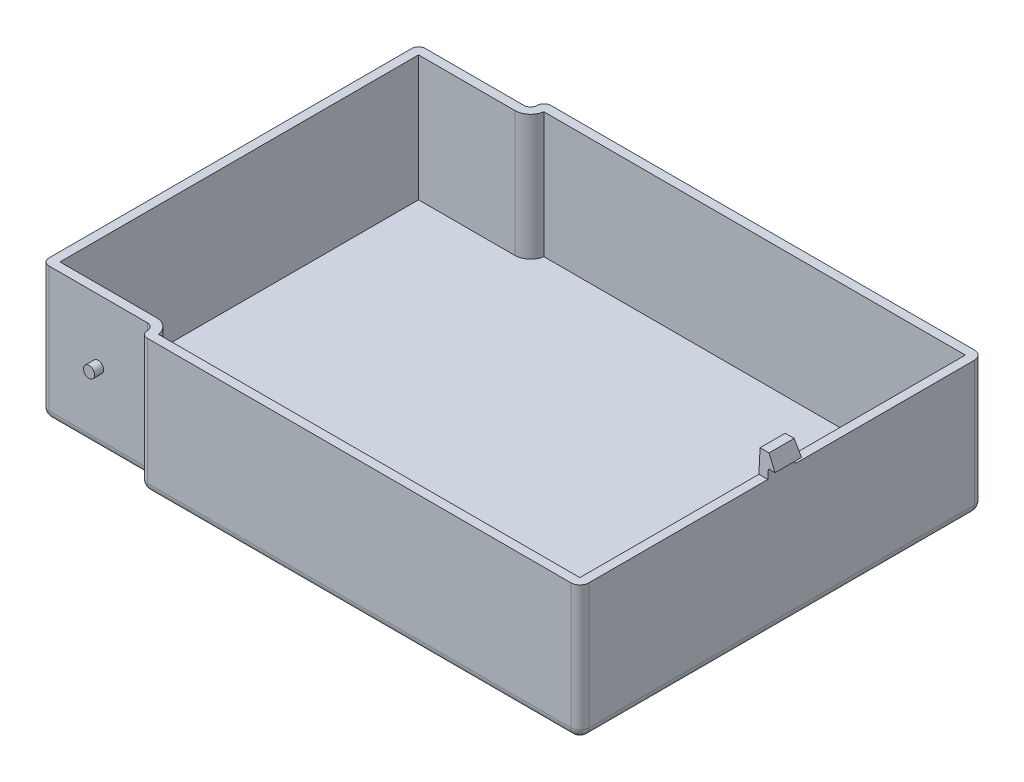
ISO-10303-21;
HEADER;
FILE_DESCRIPTION(('STEP AP214'),'2;1');
FILE_NAME('part.step','',(''),(''),'','','');
FILE_SCHEMA(('AUTOMOTIVE_DESIGN { 1 0 10303 214 1 1 1 1 }'));
ENDSEC;
DATA;
#1=APPLICATION_CONTEXT('core data for automotive mechanical design processes');
#2=APPLICATION_PROTOCOL_DEFINITION('international standard','automotive_design',2000,#1);
#3=PRODUCT_CONTEXT('',#1,'mechanical');
#4=PRODUCT('Part','Part','',(#3));
#5=PRODUCT_RELATED_PRODUCT_CATEGORY('part','',(#4));
#6=PRODUCT_DEFINITION_FORMATION('','',#4);
#7=PRODUCT_DEFINITION_CONTEXT('part definition',#1,'design');
#8=PRODUCT_DEFINITION('design','',#6,#7);
#9=PRODUCT_DEFINITION_SHAPE('','',#8);
#10=(LENGTH_UNIT() NAMED_UNIT(*) SI_UNIT(.MILLI.,.METRE.));
#11=(NAMED_UNIT(*) PLANE_ANGLE_UNIT() SI_UNIT($,.RADIAN.));
#12=(NAMED_UNIT(*) SI_UNIT($,.STERADIAN.) SOLID_ANGLE_UNIT());
#13=UNCERTAINTY_MEASURE_WITH_UNIT(LENGTH_MEASURE(1.E-05),#10,'distance_accuracy_value','');
#14=(GEOMETRIC_REPRESENTATION_CONTEXT(3) GLOBAL_UNCERTAINTY_ASSIGNED_CONTEXT((#13)) GLOBAL_UNIT_ASSIGNED_CONTEXT((#10,
#11,#12)) REPRESENTATION_CONTEXT('',''));
#15=CARTESIAN_POINT('',(0.,0.,0.));
#16=DIRECTION('',(0.,0.,1.));
#17=DIRECTION('',(1.,0.,0.));
#18=AXIS2_PLACEMENT_3D('',#15,#16,#17);
#19=CARTESIAN_POINT('',(61.5,30.,-45.));
#20=DIRECTION('',(0.,-1.,0.));
#21=DIRECTION('',(0.,0.,-1.));
#22=AXIS2_PLACEMENT_3D('',#19,#20,#21);
#23=PLANE('',#22);
#24=DIRECTION('',(-1.,0.,0.));
#25=VECTOR('',#24,1.);
#26=CARTESIAN_POINT('',(59.5,30.,-3.06203889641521));
#27=LINE('',#26,#25);
#28=CARTESIAN_POINT('',(61.5,30.,-3.06203889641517));
#29=VERTEX_POINT('',#28);
#30=CARTESIAN_POINT('',(59.5,30.,-3.0620388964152));
#31=VERTEX_POINT('',#30);
#32=EDGE_CURVE('E310',#29,#31,#27,.T.);
#33=ORIENTED_EDGE('',*,*,#32,.F.);
#34=DIRECTION('',(0.,0.,-1.));
#35=VECTOR('',#34,1.);
#36=CARTESIAN_POINT('',(61.5,30.,45.));
#37=LINE('',#36,#35);
#38=CARTESIAN_POINT('',(61.5,30.,-43.));
#39=VERTEX_POINT('',#38);
#40=EDGE_CURVE('E323',#29,#39,#37,.T.);
#41=ORIENTED_EDGE('',*,*,#40,.T.);
#42=CARTESIAN_POINT('',(59.5,30.,-43.));
#43=DIRECTION('',(0.,-1.,0.));
#44=DIRECTION('',(0.,0.,-1.));
#45=AXIS2_PLACEMENT_3D('',#42,#43,#44);
#46=CIRCLE('',#45,2.);
#47=CARTESIAN_POINT('',(59.5,30.,-45.));
#48=VERTEX_POINT('',#47);
#49=EDGE_CURVE('E400',#39,#48,#46,.F.);
#50=ORIENTED_EDGE('',*,*,#49,.T.);
#51=DIRECTION('',(-1.,0.,0.));
#52=VECTOR('',#51,1.);
#53=CARTESIAN_POINT('',(-36.5,30.,-45.));
#54=LINE('',#53,#52);
#55=CARTESIAN_POINT('',(-35.,30.,-45.));
#56=VERTEX_POINT('',#55);
#57=EDGE_CURVE('E330',#48,#56,#54,.T.);
#58=ORIENTED_EDGE('',*,*,#57,.T.);
#59=CARTESIAN_POINT('',(-35.,30.,-43.5));
#60=DIRECTION('',(0.,-1.,0.));
#61=DIRECTION('',(0.,0.,-1.));
#62=AXIS2_PLACEMENT_3D('',#59,#60,#61);
#63=CIRCLE('',#62,1.5);
#64=CARTESIAN_POINT('',(-36.5,30.,-43.5));
#65=VERTEX_POINT('',#64);
#66=EDGE_CURVE('E364',#56,#65,#63,.F.);
#67=ORIENTED_EDGE('',*,*,#66,.T.);
#68=CARTESIAN_POINT('',(-38.,30.,-43.5));
#69=DIRECTION('',(0.,-1.,0.));
#70=DIRECTION('',(0.,0.,-1.));
#71=AXIS2_PLACEMENT_3D('',#68,#69,#70);
#72=CIRCLE('',#71,1.5);
#73=CARTESIAN_POINT('',(-38.,30.,-42.));
#74=VERTEX_POINT('',#73);
#75=EDGE_CURVE('E385',#65,#74,#72,.T.);
#76=ORIENTED_EDGE('',*,*,#75,.T.);
#77=DIRECTION('',(-1.,0.,0.));
#78=VECTOR('',#77,1.);
#79=CARTESIAN_POINT('',(-36.5,30.,-42.));
#80=LINE('',#79,#78);
#81=CARTESIAN_POINT('',(-60.,30.,-42.));
#82=VERTEX_POINT('',#81);
#83=EDGE_CURVE('E344',#74,#82,#80,.T.);
#84=ORIENTED_EDGE('',*,*,#83,.T.);
#85=CARTESIAN_POINT('',(-60.,30.,-40.5));
#86=DIRECTION('',(0.,-1.,0.));
#87=DIRECTION('',(0.,0.,-1.));
#88=AXIS2_PLACEMENT_3D('',#85,#86,#87);
#89=CIRCLE('',#88,1.5);
#90=CARTESIAN_POINT('',(-61.5,30.,-40.5));
#91=VERTEX_POINT('',#90);
#92=EDGE_CURVE('E360',#82,#91,#89,.F.);
#93=ORIENTED_EDGE('',*,*,#92,.T.);
#94=DIRECTION('',(0.,0.,1.));
#95=VECTOR('',#94,1.);
#96=CARTESIAN_POINT('',(-61.5,30.,42.));
#97=LINE('',#96,#95);
#98=CARTESIAN_POINT('',(-61.5,30.,40.5));
#99=VERTEX_POINT('',#98);
#100=EDGE_CURVE('E347',#91,#99,#97,.T.);
#101=ORIENTED_EDGE('',*,*,#100,.T.);
#102=CARTESIAN_POINT('',(-60.,30.,40.5));
#103=DIRECTION('',(0.,-1.,0.));
#104=DIRECTION('',(0.,0.,-1.));
#105=AXIS2_PLACEMENT_3D('',#102,#103,#104);
#106=CIRCLE('',#105,1.5);
#107=CARTESIAN_POINT('',(-60.,30.,42.));
#108=VERTEX_POINT('',#107);
#109=EDGE_CURVE('E358',#99,#108,#106,.F.);
#110=ORIENTED_EDGE('',*,*,#109,.T.);
#111=DIRECTION('',(1.,0.,0.));
#112=VECTOR('',#111,1.);
#113=CARTESIAN_POINT('',(-36.5,30.,42.));
#114=LINE('',#113,#112);
#115=CARTESIAN_POINT('',(-38.,30.,42.));
#116=VERTEX_POINT('',#115);
#117=EDGE_CURVE('E350',#108,#116,#114,.T.);
#118=ORIENTED_EDGE('',*,*,#117,.T.);
#119=CARTESIAN_POINT('',(-38.,30.,43.5));
#120=DIRECTION('',(0.,-1.,0.));
#121=DIRECTION('',(0.,0.,-1.));
#122=AXIS2_PLACEMENT_3D('',#119,#120,#121);
#123=CIRCLE('',#122,1.5);
#124=CARTESIAN_POINT('',(-36.5,30.,43.5));
#125=VERTEX_POINT('',#124);
#126=EDGE_CURVE('E387',#116,#125,#123,.T.);
#127=ORIENTED_EDGE('',*,*,#126,.T.);
#128=CARTESIAN_POINT('',(-35.,30.,43.5));
#129=DIRECTION('',(0.,-1.,0.));
#130=DIRECTION('',(0.,0.,-1.));
#131=AXIS2_PLACEMENT_3D('',#128,#129,#130);
#132=CIRCLE('',#131,1.5);
#133=CARTESIAN_POINT('',(-35.,30.,45.));
#134=VERTEX_POINT('',#133);
#135=EDGE_CURVE('E362',#125,#134,#132,.F.);
#136=ORIENTED_EDGE('',*,*,#135,.T.);
#137=DIRECTION('',(1.,0.,0.));
#138=VECTOR('',#137,1.);
#139=CARTESIAN_POINT('',(-36.5,30.,45.));
#140=LINE('',#139,#138);
#141=CARTESIAN_POINT('',(59.5,30.,45.));
#142=VERTEX_POINT('',#141);
#143=EDGE_CURVE('E353',#134,#142,#140,.T.);
#144=ORIENTED_EDGE('',*,*,#143,.T.);
#145=CARTESIAN_POINT('',(59.5,30.,43.));
#146=DIRECTION('',(0.,-1.,0.));
#147=DIRECTION('',(0.,0.,-1.));
#148=AXIS2_PLACEMENT_3D('',#145,#146,#147);
#149=CIRCLE('',#148,2.);
#150=CARTESIAN_POINT('',(61.5,30.,43.));
#151=VERTEX_POINT('',#150);
#152=EDGE_CURVE('E398',#142,#151,#149,.F.);
#153=ORIENTED_EDGE('',*,*,#152,.T.);
#154=CARTESIAN_POINT('',(61.5,30.,3.06203889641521));
#155=VERTEX_POINT('',#154);
#156=EDGE_CURVE('E327',#151,#155,#37,.T.);
#157=ORIENTED_EDGE('',*,*,#156,.T.);
#158=DIRECTION('',(1.,0.,0.));
#159=VECTOR('',#158,1.);
#160=CARTESIAN_POINT('',(59.5,30.,3.0620388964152));
#161=LINE('',#160,#159);
#162=CARTESIAN_POINT('',(59.5,30.,3.0620388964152));
#163=VERTEX_POINT('',#162);
#164=EDGE_CURVE('E63',#163,#155,#161,.T.);
#165=ORIENTED_EDGE('',*,*,#164,.F.);
#166=DIRECTION('',(0.,0.,-1.));
#167=VECTOR('',#166,1.);
#168=CARTESIAN_POINT('',(59.5,30.,-45.));
#169=LINE('',#168,#167);
#170=CARTESIAN_POINT('',(59.5,30.,43.));
#171=VERTEX_POINT('',#170);
#172=EDGE_CURVE('E335',#171,#163,#169,.T.);
#173=ORIENTED_EDGE('',*,*,#172,.F.);
#174=DIRECTION('',(1.,0.,0.));
#175=VECTOR('',#174,1.);
#176=CARTESIAN_POINT('',(61.5,30.,43.));
#177=LINE('',#176,#175);
#178=CARTESIAN_POINT('',(-34.5358983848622,30.,43.));
#179=VERTEX_POINT('',#178);
#180=EDGE_CURVE('E339',#179,#171,#177,.T.);
#181=ORIENTED_EDGE('',*,*,#180,.F.);
#182=CARTESIAN_POINT('',(-38.,30.,43.5));
#183=DIRECTION('',(0.,-1.,0.));
#184=DIRECTION('',(0.,0.,-1.));
#185=AXIS2_PLACEMENT_3D('',#182,#183,#184);
#186=CIRCLE('',#185,3.5);
#187=CARTESIAN_POINT('',(-38.,30.,40.));
#188=VERTEX_POINT('',#187);
#189=EDGE_CURVE('E1153',#188,#179,#186,.T.);
#190=ORIENTED_EDGE('',*,*,#189,.F.);
#191=DIRECTION('',(1.,0.,0.));
#192=VECTOR('',#191,1.);
#193=CARTESIAN_POINT('',(61.5,30.,40.));
#194=LINE('',#193,#192);
#195=CARTESIAN_POINT('',(-59.5,30.,40.));
#196=VERTEX_POINT('',#195);
#197=EDGE_CURVE('E1110',#196,#188,#194,.T.);
#198=ORIENTED_EDGE('',*,*,#197,.F.);
#199=DIRECTION('',(0.,0.,1.));
#200=VECTOR('',#199,1.);
#201=CARTESIAN_POINT('',(-59.5,30.,-45.));
#202=LINE('',#201,#200);
#203=CARTESIAN_POINT('',(-59.5,30.,-40.));
#204=VERTEX_POINT('',#203);
#205=EDGE_CURVE('E1156',#204,#196,#202,.T.);
#206=ORIENTED_EDGE('',*,*,#205,.F.);
#207=DIRECTION('',(-1.,0.,0.));
#208=VECTOR('',#207,1.);
#209=CARTESIAN_POINT('',(61.5,30.,-40.));
#210=LINE('',#209,#208);
#211=CARTESIAN_POINT('',(-38.,30.,-40.));
#212=VERTEX_POINT('',#211);
#213=EDGE_CURVE('E1113',#212,#204,#210,.T.);
#214=ORIENTED_EDGE('',*,*,#213,.F.);
#215=CARTESIAN_POINT('',(-38.,30.,-43.5));
#216=DIRECTION('',(0.,-1.,0.));
#217=DIRECTION('',(0.,0.,-1.));
#218=AXIS2_PLACEMENT_3D('',#215,#216,#217);
#219=CIRCLE('',#218,3.5);
#220=CARTESIAN_POINT('',(-34.5358983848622,30.,-43.));
#221=VERTEX_POINT('',#220);
#222=EDGE_CURVE('E1147',#221,#212,#219,.T.);
#223=ORIENTED_EDGE('',*,*,#222,.F.);
#224=DIRECTION('',(-1.,0.,0.));
#225=VECTOR('',#224,1.);
#226=CARTESIAN_POINT('',(61.5,30.,-43.));
#227=LINE('',#226,#225);
#228=CARTESIAN_POINT('',(59.5,30.,-43.));
#229=VERTEX_POINT('',#228);
#230=EDGE_CURVE('E1111',#229,#221,#227,.T.);
#231=ORIENTED_EDGE('',*,*,#230,.F.);
#232=EDGE_CURVE('E56',#31,#229,#169,.T.);
#233=ORIENTED_EDGE('',*,*,#232,.F.);
#234=EDGE_LOOP('',(#33,#41,#50,#58,#67,#76,#84,#93,#101,#110,#118,#127,#136,#144,#153,#157,#165,
#173,#181,#190,#198,#206,#214,#223,#231,#233));
#235=FACE_BOUND('',#234,.T.);
#236=ADVANCED_FACE('F38',(#235),#23,.F.);
#237=CARTESIAN_POINT('',(61.5,30.,45.));
#238=DIRECTION('',(-1.,0.,0.));
#239=DIRECTION('',(0.,0.,1.));
#240=AXIS2_PLACEMENT_3D('',#237,#238,#239);
#241=PLANE('',#240);
#242=DIRECTION('',(0.,-1.,0.));
#243=VECTOR('',#242,1.);
#244=CARTESIAN_POINT('',(61.5,30.,43.));
#245=LINE('',#244,#243);
#246=CARTESIAN_POINT('',(61.5,2.,43.));
#247=VERTEX_POINT('',#246);
#248=EDGE_CURVE('E395',#151,#247,#245,.T.);
#249=ORIENTED_EDGE('',*,*,#248,.T.);
#250=DIRECTION('',(0.,0.,-1.));
#251=VECTOR('',#250,1.);
#252=CARTESIAN_POINT('',(61.5,2.,-43.));
#253=LINE('',#252,#251);
#254=CARTESIAN_POINT('',(61.5,2.,-43.));
#255=VERTEX_POINT('',#254);
#256=EDGE_CURVE('E446',#247,#255,#253,.T.);
#257=ORIENTED_EDGE('',*,*,#256,.T.);
#258=DIRECTION('',(0.,-1.,0.));
#259=VECTOR('',#258,1.);
#260=CARTESIAN_POINT('',(61.5,30.,-43.));
#261=LINE('',#260,#259);
#262=EDGE_CURVE('E325',#255,#39,#261,.F.);
#263=ORIENTED_EDGE('',*,*,#262,.T.);
#264=ORIENTED_EDGE('',*,*,#40,.F.);
#265=DIRECTION('',(0.,-0.998629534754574,-0.0523359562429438));
#266=VECTOR('',#265,1.);
#267=CARTESIAN_POINT('',(61.5,35.,-2.8));
#268=LINE('',#267,#266);
#269=CARTESIAN_POINT('',(61.5,32.,-2.95722333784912));
#270=VERTEX_POINT('',#269);
#271=EDGE_CURVE('E286',#270,#29,#268,.T.);
#272=ORIENTED_EDGE('',*,*,#271,.F.);
#273=DIRECTION('',(0.,0.,-1.));
#274=VECTOR('',#273,1.);
#275=CARTESIAN_POINT('',(61.5,32.,0.));
#276=LINE('',#275,#274);
#277=CARTESIAN_POINT('',(61.5,32.,2.95722333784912));
#278=VERTEX_POINT('',#277);
#279=EDGE_CURVE('E257',#278,#270,#276,.T.);
#280=ORIENTED_EDGE('',*,*,#279,.F.);
#281=DIRECTION('',(0.,0.998629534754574,-0.0523359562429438));
#282=VECTOR('',#281,1.);
#283=CARTESIAN_POINT('',(61.5,35.,2.8));
#284=LINE('',#283,#282);
#285=EDGE_CURVE('E299',#155,#278,#284,.T.);
#286=ORIENTED_EDGE('',*,*,#285,.F.);
#287=ORIENTED_EDGE('',*,*,#156,.F.);
#288=EDGE_LOOP('',(#249,#257,#263,#264,#272,#280,#286,#287));
#289=FACE_BOUND('',#288,.T.);
#290=ADVANCED_FACE('F320',(#289),#241,.F.);
#291=CARTESIAN_POINT('',(-36.5,30.,-45.));
#292=DIRECTION('',(0.,0.,1.));
#293=DIRECTION('',(1.,0.,0.));
#294=AXIS2_PLACEMENT_3D('',#291,#292,#293);
#295=PLANE('',#294);
#296=DIRECTION('',(0.,-1.,0.));
#297=VECTOR('',#296,1.);
#298=CARTESIAN_POINT('',(59.5,30.,-45.));
#299=LINE('',#298,#297);
#300=CARTESIAN_POINT('',(59.5,2.,-45.));
#301=VERTEX_POINT('',#300);
#302=EDGE_CURVE('E388',#48,#301,#299,.T.);
#303=ORIENTED_EDGE('',*,*,#302,.T.);
#304=DIRECTION('',(-1.,0.,0.));
#305=VECTOR('',#304,1.);
#306=CARTESIAN_POINT('',(-35.,2.,-45.));
#307=LINE('',#306,#305);
#308=CARTESIAN_POINT('',(-35.,2.,-45.));
#309=VERTEX_POINT('',#308);
#310=EDGE_CURVE('E440',#301,#309,#307,.T.);
#311=ORIENTED_EDGE('',*,*,#310,.T.);
#312=DIRECTION('',(0.,-1.,0.));
#313=VECTOR('',#312,1.);
#314=CARTESIAN_POINT('',(-35.,30.,-45.));
#315=LINE('',#314,#313);
#316=EDGE_CURVE('E356',#309,#56,#315,.F.);
#317=ORIENTED_EDGE('',*,*,#316,.T.);
#318=ORIENTED_EDGE('',*,*,#57,.F.);
#319=EDGE_LOOP('',(#303,#311,#317,#318));
#320=FACE_BOUND('',#319,.T.);
#321=ADVANCED_FACE('F674',(#320),#295,.F.);
#322=CARTESIAN_POINT('',(-36.5,30.,-42.));
#323=DIRECTION('',(0.,0.,1.));
#324=DIRECTION('',(1.,0.,0.));
#325=AXIS2_PLACEMENT_3D('',#322,#323,#324);
#326=PLANE('',#325);
#327=CARTESIAN_POINT('',(-49.,16.,-42.));
#328=DIRECTION('',(0.,0.,1.));
#329=DIRECTION('',(1.,0.,0.));
#330=AXIS2_PLACEMENT_3D('',#327,#328,#329);
#331=CIRCLE('',#330,1.25);
#332=CARTESIAN_POINT('',(-47.75,16.,-42.));
#333=VERTEX_POINT('',#332);
#334=EDGE_CURVE('E269',#333,#333,#331,.T.);
#335=ORIENTED_EDGE('',*,*,#334,.T.);
#336=EDGE_LOOP('',(#335));
#337=FACE_BOUND('',#336,.T.);
#338=DIRECTION('',(0.,-1.,0.));
#339=VECTOR('',#338,1.);
#340=CARTESIAN_POINT('',(-38.,0.,-42.));
#341=LINE('',#340,#339);
#342=CARTESIAN_POINT('',(-38.,2.,-42.));
#343=VERTEX_POINT('',#342);
#344=EDGE_CURVE('E372',#74,#343,#341,.T.);
#345=ORIENTED_EDGE('',*,*,#344,.T.);
#346=DIRECTION('',(-1.,0.,0.));
#347=VECTOR('',#346,1.);
#348=CARTESIAN_POINT('',(-60.,2.,-42.));
#349=LINE('',#348,#347);
#350=CARTESIAN_POINT('',(-60.,2.,-42.));
#351=VERTEX_POINT('',#350);
#352=EDGE_CURVE('E434',#343,#351,#349,.T.);
#353=ORIENTED_EDGE('',*,*,#352,.T.);
#354=DIRECTION('',(0.,-1.,0.));
#355=VECTOR('',#354,1.);
#356=CARTESIAN_POINT('',(-60.,30.,-42.));
#357=LINE('',#356,#355);
#358=EDGE_CURVE('E370',#351,#82,#357,.F.);
#359=ORIENTED_EDGE('',*,*,#358,.T.);
#360=ORIENTED_EDGE('',*,*,#83,.F.);
#361=EDGE_LOOP('',(#345,#353,#359,#360));
#362=FACE_BOUND('',#361,.T.);
#363=ADVANCED_FACE('F593',(#337,#362),#326,.F.);
#364=CARTESIAN_POINT('',(-61.5,30.,42.));
#365=DIRECTION('',(1.,0.,0.));
#366=DIRECTION('',(0.,0.,-1.));
#367=AXIS2_PLACEMENT_3D('',#364,#365,#366);
#368=PLANE('',#367);
#369=DIRECTION('',(0.,-1.,0.));
#370=VECTOR('',#369,1.);
#371=CARTESIAN_POINT('',(-61.5,30.,-40.5));
#372=LINE('',#371,#370);
#373=CARTESIAN_POINT('',(-61.5,2.,-40.5));
#374=VERTEX_POINT('',#373);
#375=EDGE_CURVE('E377',#91,#374,#372,.T.);
#376=ORIENTED_EDGE('',*,*,#375,.T.);
#377=DIRECTION('',(0.,0.,1.));
#378=VECTOR('',#377,1.);
#379=CARTESIAN_POINT('',(-61.5,2.,40.5));
#380=LINE('',#379,#378);
#381=CARTESIAN_POINT('',(-61.5,2.,40.5));
#382=VERTEX_POINT('',#381);
#383=EDGE_CURVE('E430',#374,#382,#380,.T.);
#384=ORIENTED_EDGE('',*,*,#383,.T.);
#385=DIRECTION('',(0.,-1.,0.));
#386=VECTOR('',#385,1.);
#387=CARTESIAN_POINT('',(-61.5,30.,40.5));
#388=LINE('',#387,#386);
#389=EDGE_CURVE('E375',#382,#99,#388,.F.);
#390=ORIENTED_EDGE('',*,*,#389,.T.);
#391=ORIENTED_EDGE('',*,*,#100,.F.);
#392=EDGE_LOOP('',(#376,#384,#390,#391));
#393=FACE_BOUND('',#392,.T.);
#394=ADVANCED_FACE('F604',(#393),#368,.F.);
#395=CARTESIAN_POINT('',(-36.5,30.,42.));
#396=DIRECTION('',(0.,0.,-1.));
#397=DIRECTION('',(-1.,0.,0.));
#398=AXIS2_PLACEMENT_3D('',#395,#396,#397);
#399=PLANE('',#398);
#400=CARTESIAN_POINT('',(-49.,16.,42.));
#401=DIRECTION('',(0.,0.,-1.));
#402=DIRECTION('',(-1.,0.,0.));
#403=AXIS2_PLACEMENT_3D('',#400,#401,#402);
#404=CIRCLE('',#403,1.25);
#405=CARTESIAN_POINT('',(-50.25,16.,42.));
#406=VERTEX_POINT('',#405);
#407=EDGE_CURVE('E12',#406,#406,#404,.F.);
#408=ORIENTED_EDGE('',*,*,#407,.F.);
#409=EDGE_LOOP('',(#408));
#410=FACE_BOUND('',#409,.T.);
#411=DIRECTION('',(0.,-1.,0.));
#412=VECTOR('',#411,1.);
#413=CARTESIAN_POINT('',(-60.,30.,42.));
#414=LINE('',#413,#412);
#415=CARTESIAN_POINT('',(-60.,2.,42.));
#416=VERTEX_POINT('',#415);
#417=EDGE_CURVE('E382',#108,#416,#414,.T.);
#418=ORIENTED_EDGE('',*,*,#417,.T.);
#419=DIRECTION('',(1.,0.,0.));
#420=VECTOR('',#419,1.);
#421=CARTESIAN_POINT('',(-38.,2.,42.));
#422=LINE('',#421,#420);
#423=CARTESIAN_POINT('',(-38.,2.,42.));
#424=VERTEX_POINT('',#423);
#425=EDGE_CURVE('E426',#416,#424,#422,.T.);
#426=ORIENTED_EDGE('',*,*,#425,.T.);
#427=DIRECTION('',(0.,-1.,0.));
#428=VECTOR('',#427,1.);
#429=CARTESIAN_POINT('',(-38.,30.,42.));
#430=LINE('',#429,#428);
#431=EDGE_CURVE('E380',#424,#116,#430,.F.);
#432=ORIENTED_EDGE('',*,*,#431,.T.);
#433=ORIENTED_EDGE('',*,*,#117,.F.);
#434=EDGE_LOOP('',(#418,#426,#432,#433));
#435=FACE_BOUND('',#434,.T.);
#436=ADVANCED_FACE('F623',(#410,#435),#399,.F.);
#437=CARTESIAN_POINT('',(-36.5,30.,45.));
#438=DIRECTION('',(0.,0.,-1.));
#439=DIRECTION('',(-1.,0.,0.));
#440=AXIS2_PLACEMENT_3D('',#437,#438,#439);
#441=PLANE('',#440);
#442=DIRECTION('',(0.,-1.,0.));
#443=VECTOR('',#442,1.);
#444=CARTESIAN_POINT('',(-35.,30.,45.));
#445=LINE('',#444,#443);
#446=CARTESIAN_POINT('',(-35.,2.,45.));
#447=VERTEX_POINT('',#446);
#448=EDGE_CURVE('E367',#134,#447,#445,.T.);
#449=ORIENTED_EDGE('',*,*,#448,.T.);
#450=DIRECTION('',(1.,0.,0.));
#451=VECTOR('',#450,1.);
#452=CARTESIAN_POINT('',(59.5,2.,45.));
#453=LINE('',#452,#451);
#454=CARTESIAN_POINT('',(59.5,2.,45.));
#455=VERTEX_POINT('',#454);
#456=EDGE_CURVE('E48',#447,#455,#453,.T.);
#457=ORIENTED_EDGE('',*,*,#456,.T.);
#458=DIRECTION('',(0.,-1.,0.));
#459=VECTOR('',#458,1.);
#460=CARTESIAN_POINT('',(59.5,30.,45.));
#461=LINE('',#460,#459);
#462=EDGE_CURVE('E402',#455,#142,#461,.F.);
#463=ORIENTED_EDGE('',*,*,#462,.T.);
#464=ORIENTED_EDGE('',*,*,#143,.F.);
#465=EDGE_LOOP('',(#449,#457,#463,#464));
#466=FACE_BOUND('',#465,.T.);
#467=ADVANCED_FACE('F639',(#466),#441,.F.);
#468=CARTESIAN_POINT('',(61.5,0.,-45.));
#469=DIRECTION('',(0.,-1.,0.));
#470=DIRECTION('',(0.,0.,-1.));
#471=AXIS2_PLACEMENT_3D('',#468,#469,#470);
#472=PLANE('',#471);
#473=DIRECTION('',(1.,0.,0.));
#474=VECTOR('',#473,1.);
#475=CARTESIAN_POINT('',(-35.,0.,43.));
#476=LINE('',#475,#474);
#477=CARTESIAN_POINT('',(59.5,0.,43.));
#478=VERTEX_POINT('',#477);
#479=CARTESIAN_POINT('',(-34.5358983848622,0.,43.));
#480=VERTEX_POINT('',#479);
#481=EDGE_CURVE('E407',#478,#480,#476,.F.);
#482=ORIENTED_EDGE('',*,*,#481,.T.);
#483=CARTESIAN_POINT('',(-38.,0.,43.5));
#484=DIRECTION('',(0.,-1.,0.));
#485=DIRECTION('',(0.,0.,-1.));
#486=AXIS2_PLACEMENT_3D('',#483,#484,#485);
#487=CIRCLE('',#486,3.5);
#488=CARTESIAN_POINT('',(-38.,0.,40.));
#489=VERTEX_POINT('',#488);
#490=EDGE_CURVE('E421',#480,#489,#487,.F.);
#491=ORIENTED_EDGE('',*,*,#490,.T.);
#492=DIRECTION('',(1.,0.,0.));
#493=VECTOR('',#492,1.);
#494=CARTESIAN_POINT('',(-60.,0.,40.));
#495=LINE('',#494,#493);
#496=CARTESIAN_POINT('',(-59.5,0.,40.));
#497=VERTEX_POINT('',#496);
#498=EDGE_CURVE('E419',#489,#497,#495,.F.);
#499=ORIENTED_EDGE('',*,*,#498,.T.);
#500=DIRECTION('',(0.,0.,1.));
#501=VECTOR('',#500,1.);
#502=CARTESIAN_POINT('',(-59.5,0.,-40.5));
#503=LINE('',#502,#501);
#504=CARTESIAN_POINT('',(-59.5,0.,-40.));
#505=VERTEX_POINT('',#504);
#506=EDGE_CURVE('E417',#497,#505,#503,.F.);
#507=ORIENTED_EDGE('',*,*,#506,.T.);
#508=DIRECTION('',(-1.,0.,0.));
#509=VECTOR('',#508,1.);
#510=CARTESIAN_POINT('',(-38.,0.,-40.));
#511=LINE('',#510,#509);
#512=CARTESIAN_POINT('',(-38.,0.,-40.));
#513=VERTEX_POINT('',#512);
#514=EDGE_CURVE('E415',#505,#513,#511,.F.);
#515=ORIENTED_EDGE('',*,*,#514,.T.);
#516=CARTESIAN_POINT('',(-38.,0.,-43.5));
#517=DIRECTION('',(0.,-1.,0.));
#518=DIRECTION('',(0.,0.,-1.));
#519=AXIS2_PLACEMENT_3D('',#516,#517,#518);
#520=CIRCLE('',#519,3.5);
#521=CARTESIAN_POINT('',(-34.5358983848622,0.,-43.));
#522=VERTEX_POINT('',#521);
#523=EDGE_CURVE('E413',#513,#522,#520,.F.);
#524=ORIENTED_EDGE('',*,*,#523,.T.);
#525=DIRECTION('',(-1.,0.,0.));
#526=VECTOR('',#525,1.);
#527=CARTESIAN_POINT('',(59.5,0.,-43.));
#528=LINE('',#527,#526);
#529=CARTESIAN_POINT('',(59.5,0.,-43.));
#530=VERTEX_POINT('',#529);
#531=EDGE_CURVE('E411',#522,#530,#528,.F.);
#532=ORIENTED_EDGE('',*,*,#531,.T.);
#533=DIRECTION('',(0.,0.,-1.));
#534=VECTOR('',#533,1.);
#535=CARTESIAN_POINT('',(59.5,0.,43.));
#536=LINE('',#535,#534);
#537=EDGE_CURVE('E409',#530,#478,#536,.F.);
#538=ORIENTED_EDGE('',*,*,#537,.T.);
#539=EDGE_LOOP('',(#482,#491,#499,#507,#515,#524,#532,#538));
#540=FACE_BOUND('',#539,.T.);
#541=ADVANCED_FACE('F658',(#540),#472,.T.);
#542=CARTESIAN_POINT('',(-38.,30.,-43.5));
#543=DIRECTION('',(0.,1.,0.));
#544=DIRECTION('',(0.,0.,1.));
#545=AXIS2_PLACEMENT_3D('',#542,#543,#544);
#546=CYLINDRICAL_SURFACE('',#545,1.5);
#547=DIRECTION('',(0.,-1.,0.));
#548=VECTOR('',#547,1.);
#549=CARTESIAN_POINT('',(-36.5,30.,-43.5));
#550=LINE('',#549,#548);
#551=CARTESIAN_POINT('',(-36.5,2.,-43.5));
#552=VERTEX_POINT('',#551);
#553=EDGE_CURVE('E328',#552,#65,#550,.F.);
#554=ORIENTED_EDGE('',*,*,#553,.F.);
#555=CARTESIAN_POINT('',(-38.,2.,-43.5));
#556=DIRECTION('',(0.,-1.,0.));
#557=DIRECTION('',(0.,0.,-1.));
#558=AXIS2_PLACEMENT_3D('',#555,#556,#557);
#559=CIRCLE('',#558,1.5);
#560=EDGE_CURVE('E436',#552,#343,#559,.T.);
#561=ORIENTED_EDGE('',*,*,#560,.T.);
#562=ORIENTED_EDGE('',*,*,#344,.F.);
#563=ORIENTED_EDGE('',*,*,#75,.F.);
#564=EDGE_LOOP('',(#554,#561,#562,#563));
#565=FACE_BOUND('',#564,.T.);
#566=ADVANCED_FACE('F589',(#565),#546,.F.);
#567=CARTESIAN_POINT('',(-35.,30.,-43.5));
#568=DIRECTION('',(0.,-1.,0.));
#569=DIRECTION('',(0.,0.,-1.));
#570=AXIS2_PLACEMENT_3D('',#567,#568,#569);
#571=CYLINDRICAL_SURFACE('',#570,1.5);
#572=ORIENTED_EDGE('',*,*,#316,.F.);
#573=CARTESIAN_POINT('',(-35.,2.,-43.5));
#574=DIRECTION('',(0.,1.,0.));
#575=DIRECTION('',(0.,0.,1.));
#576=AXIS2_PLACEMENT_3D('',#573,#574,#575);
#577=CIRCLE('',#576,1.5);
#578=EDGE_CURVE('E438',#309,#552,#577,.T.);
#579=ORIENTED_EDGE('',*,*,#578,.T.);
#580=ORIENTED_EDGE('',*,*,#553,.T.);
#581=ORIENTED_EDGE('',*,*,#66,.F.);
#582=EDGE_LOOP('',(#572,#579,#580,#581));
#583=FACE_BOUND('',#582,.T.);
#584=ADVANCED_FACE('F678',(#583),#571,.T.);
#585=CARTESIAN_POINT('',(-38.,30.,43.5));
#586=DIRECTION('',(0.,1.,0.));
#587=DIRECTION('',(0.,0.,1.));
#588=AXIS2_PLACEMENT_3D('',#585,#586,#587);
#589=CYLINDRICAL_SURFACE('',#588,1.5);
#590=ORIENTED_EDGE('',*,*,#431,.F.);
#591=CARTESIAN_POINT('',(-38.,2.,43.5));
#592=DIRECTION('',(0.,-1.,0.));
#593=DIRECTION('',(0.,0.,-1.));
#594=AXIS2_PLACEMENT_3D('',#591,#592,#593);
#595=CIRCLE('',#594,1.5);
#596=CARTESIAN_POINT('',(-36.5,2.,43.5));
#597=VERTEX_POINT('',#596);
#598=EDGE_CURVE('E424',#424,#597,#595,.T.);
#599=ORIENTED_EDGE('',*,*,#598,.T.);
#600=DIRECTION('',(0.,-1.,0.));
#601=VECTOR('',#600,1.);
#602=CARTESIAN_POINT('',(-36.5,0.,43.5));
#603=LINE('',#602,#601);
#604=EDGE_CURVE('E332',#125,#597,#603,.T.);
#605=ORIENTED_EDGE('',*,*,#604,.F.);
#606=ORIENTED_EDGE('',*,*,#126,.F.);
#607=EDGE_LOOP('',(#590,#599,#605,#606));
#608=FACE_BOUND('',#607,.T.);
#609=ADVANCED_FACE('F628',(#608),#589,.F.);
#610=CARTESIAN_POINT('',(-35.,30.,43.5));
#611=DIRECTION('',(0.,-1.,0.));
#612=DIRECTION('',(0.,0.,-1.));
#613=AXIS2_PLACEMENT_3D('',#610,#611,#612);
#614=CYLINDRICAL_SURFACE('',#613,1.5);
#615=ORIENTED_EDGE('',*,*,#604,.T.);
#616=CARTESIAN_POINT('',(-35.,2.,43.5));
#617=DIRECTION('',(0.,1.,0.));
#618=DIRECTION('',(0.,0.,1.));
#619=AXIS2_PLACEMENT_3D('',#616,#617,#618);
#620=CIRCLE('',#619,1.5);
#621=EDGE_CURVE('E404',#597,#447,#620,.T.);
#622=ORIENTED_EDGE('',*,*,#621,.T.);
#623=ORIENTED_EDGE('',*,*,#448,.F.);
#624=ORIENTED_EDGE('',*,*,#135,.F.);
#625=EDGE_LOOP('',(#615,#622,#623,#624));
#626=FACE_BOUND('',#625,.T.);
#627=ADVANCED_FACE('F635',(#626),#614,.T.);
#628=CARTESIAN_POINT('',(-60.,30.,-40.5));
#629=DIRECTION('',(0.,-1.,0.));
#630=DIRECTION('',(0.,0.,-1.));
#631=AXIS2_PLACEMENT_3D('',#628,#629,#630);
#632=CYLINDRICAL_SURFACE('',#631,1.5);
#633=ORIENTED_EDGE('',*,*,#358,.F.);
#634=CARTESIAN_POINT('',(-60.,2.,-40.5));
#635=DIRECTION('',(0.,1.,0.));
#636=DIRECTION('',(0.,0.,1.));
#637=AXIS2_PLACEMENT_3D('',#634,#635,#636);
#638=CIRCLE('',#637,1.5);
#639=EDGE_CURVE('E432',#351,#374,#638,.T.);
#640=ORIENTED_EDGE('',*,*,#639,.T.);
#641=ORIENTED_EDGE('',*,*,#375,.F.);
#642=ORIENTED_EDGE('',*,*,#92,.F.);
#643=EDGE_LOOP('',(#633,#640,#641,#642));
#644=FACE_BOUND('',#643,.T.);
#645=ADVANCED_FACE('F599',(#644),#632,.T.);
#646=CARTESIAN_POINT('',(-60.,30.,40.5));
#647=DIRECTION('',(0.,-1.,0.));
#648=DIRECTION('',(0.,0.,-1.));
#649=AXIS2_PLACEMENT_3D('',#646,#647,#648);
#650=CYLINDRICAL_SURFACE('',#649,1.5);
#651=ORIENTED_EDGE('',*,*,#389,.F.);
#652=CARTESIAN_POINT('',(-60.,2.,40.5));
#653=DIRECTION('',(0.,1.,0.));
#654=DIRECTION('',(0.,0.,1.));
#655=AXIS2_PLACEMENT_3D('',#652,#653,#654);
#656=CIRCLE('',#655,1.5);
#657=EDGE_CURVE('E428',#382,#416,#656,.T.);
#658=ORIENTED_EDGE('',*,*,#657,.T.);
#659=ORIENTED_EDGE('',*,*,#417,.F.);
#660=ORIENTED_EDGE('',*,*,#109,.F.);
#661=EDGE_LOOP('',(#651,#658,#659,#660));
#662=FACE_BOUND('',#661,.T.);
#663=ADVANCED_FACE('F619',(#662),#650,.T.);
#664=CARTESIAN_POINT('',(59.5,30.,-43.));
#665=DIRECTION('',(0.,-1.,0.));
#666=DIRECTION('',(0.,0.,-1.));
#667=AXIS2_PLACEMENT_3D('',#664,#665,#666);
#668=CYLINDRICAL_SURFACE('',#667,2.);
#669=ORIENTED_EDGE('',*,*,#262,.F.);
#670=CARTESIAN_POINT('',(59.5,2.,-43.));
#671=DIRECTION('',(0.,-1.,0.));
#672=DIRECTION('',(0.,0.,-1.));
#673=AXIS2_PLACEMENT_3D('',#670,#671,#672);
#674=CIRCLE('',#673,2.);
#675=EDGE_CURVE('E442',#255,#301,#674,.F.);
#676=ORIENTED_EDGE('',*,*,#675,.T.);
#677=ORIENTED_EDGE('',*,*,#302,.F.);
#678=ORIENTED_EDGE('',*,*,#49,.F.);
#679=EDGE_LOOP('',(#669,#676,#677,#678));
#680=FACE_BOUND('',#679,.T.);
#681=ADVANCED_FACE('F667',(#680),#668,.T.);
#682=CARTESIAN_POINT('',(59.5,30.,43.));
#683=DIRECTION('',(0.,-1.,0.));
#684=DIRECTION('',(0.,0.,-1.));
#685=AXIS2_PLACEMENT_3D('',#682,#683,#684);
#686=CYLINDRICAL_SURFACE('',#685,2.);
#687=ORIENTED_EDGE('',*,*,#462,.F.);
#688=CARTESIAN_POINT('',(59.5,2.,43.));
#689=DIRECTION('',(0.,-1.,0.));
#690=DIRECTION('',(0.,0.,-1.));
#691=AXIS2_PLACEMENT_3D('',#688,#689,#690);
#692=CIRCLE('',#691,2.);
#693=EDGE_CURVE('E444',#455,#247,#692,.F.);
#694=ORIENTED_EDGE('',*,*,#693,.T.);
#695=ORIENTED_EDGE('',*,*,#248,.F.);
#696=ORIENTED_EDGE('',*,*,#152,.F.);
#697=EDGE_LOOP('',(#687,#694,#695,#696));
#698=FACE_BOUND('',#697,.T.);
#699=ADVANCED_FACE('F644',(#698),#686,.T.);
#700=CARTESIAN_POINT('',(-38.,2.,-43.5));
#701=DIRECTION('',(0.,-1.,0.));
#702=DIRECTION('',(0.,0.,-1.));
#703=AXIS2_PLACEMENT_3D('',#700,#701,#702);
#704=TOROIDAL_SURFACE('',#703,3.5,2.);
#705=CARTESIAN_POINT('',(-38.,2.,-40.));
#706=DIRECTION('',(-1.,0.,0.));
#707=DIRECTION('',(0.,0.,1.));
#708=AXIS2_PLACEMENT_3D('',#705,#706,#707);
#709=CIRCLE('',#708,2.);
#710=EDGE_CURVE('E567',#343,#513,#709,.T.);
#711=ORIENTED_EDGE('',*,*,#710,.F.);
#712=ORIENTED_EDGE('',*,*,#560,.F.);
#713=CARTESIAN_POINT('',(-34.9823965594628,2.52677714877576,-44.9293796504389));
#714=CARTESIAN_POINT('',(-36.3286799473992,2.86685645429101,-44.8365280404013));
#715=CARTESIAN_POINT('',(-36.4294065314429,2.52677714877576,-43.4908109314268));
#716=CARTESIAN_POINT('',(-34.9852474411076,2.48477390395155,-44.9408497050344));
#717=CARTESIAN_POINT('',(-36.3545627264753,2.80555885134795,-44.8612760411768));
#718=CARTESIAN_POINT('',(-36.4408677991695,2.48477390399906,-43.4923611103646));
#719=CARTESIAN_POINT('',(-34.987780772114,2.44208568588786,-44.9510267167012));
#720=CARTESIAN_POINT('',(-36.3782809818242,2.74092173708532,-44.8839298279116));
#721=CARTESIAN_POINT('',(-36.4510390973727,2.44208568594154,-43.4937096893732));
#722=CARTESIAN_POINT('',(-34.9921676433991,2.35557859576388,-44.9686329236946));
#723=CARTESIAN_POINT('',(-36.4204668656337,2.60508959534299,-44.9241955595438));
#724=CARTESIAN_POINT('',(-36.468637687,2.35557859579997,-43.4960132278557));
#725=CARTESIAN_POINT('',(-34.9940208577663,2.31175919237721,-44.9760608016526));
#726=CARTESIAN_POINT('',(-36.4388310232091,2.53400538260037,-44.9417084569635));
#727=CARTESIAN_POINT('',(-36.4760636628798,2.31175919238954,-43.4969679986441));
#728=CARTESIAN_POINT('',(-34.9984749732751,2.17945814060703,-44.9939047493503));
#729=CARTESIAN_POINT('',(-36.4838663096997,2.31291804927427,-44.9846421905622));
#730=CARTESIAN_POINT('',(-36.4939041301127,2.17945814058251,-43.4992465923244));
#731=CARTESIAN_POINT('',(-34.9999991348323,2.08971711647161,-44.999996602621));
#732=CARTESIAN_POINT('',(-36.4999908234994,2.15696608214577,-44.9999913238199));
#733=CARTESIAN_POINT('',(-36.4999965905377,2.08971711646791,-43.4999996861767));
#734=CARTESIAN_POINT('',(-35.0000008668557,1.91010783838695,-45.0000034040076));
#735=CARTESIAN_POINT('',(-36.500009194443,1.84272700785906,-45.0000086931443));
#736=CARTESIAN_POINT('',(-36.5000034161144,1.91010783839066,-43.5000003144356));
#737=CARTESIAN_POINT('',(-34.9984724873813,1.82023967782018,-44.9938945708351));
#738=CARTESIAN_POINT('',(-36.4838400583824,1.6865322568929,-44.984616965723));
#739=CARTESIAN_POINT('',(-36.4938939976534,1.82023967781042,-43.4992449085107));
#740=CARTESIAN_POINT('',(-34.9925141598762,1.6437172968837,-44.9700249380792));
#741=CARTESIAN_POINT('',(-36.4237873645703,1.39256219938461,-44.9273670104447));
#742=CARTESIAN_POINT('',(-36.4700289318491,1.64371729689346,-43.4961976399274));
#743=CARTESIAN_POINT('',(-34.9880848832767,1.55706233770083,-44.9522668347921));
#744=CARTESIAN_POINT('',(-36.3806015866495,1.25626623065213,-44.886174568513));
#745=CARTESIAN_POINT('',(-36.4522759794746,1.55706233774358,-43.4939061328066));
#746=CARTESIAN_POINT('',(-34.9767470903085,1.38995603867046,-44.9066487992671));
#747=CARTESIAN_POINT('',(-36.2782337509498,1.01351960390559,-44.7882923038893));
#748=CARTESIAN_POINT('',(-36.4066932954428,1.389956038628,-43.4877368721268));
#749=CARTESIAN_POINT('',(-34.96985571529,1.30946636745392,-44.8788586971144));
#750=CARTESIAN_POINT('',(-36.2199196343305,0.907231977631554,-44.7324380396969));
#751=CARTESIAN_POINT('',(-36.3789332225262,1.30946636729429,-43.4838700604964));
#752=CARTESIAN_POINT('',(-34.9540433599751,1.15533572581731,-44.8148071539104));
#753=CARTESIAN_POINT('',(-36.0976187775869,0.722953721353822,-44.6148919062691));
#754=CARTESIAN_POINT('',(-36.3149952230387,1.15533572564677,-43.4744600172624));
#755=CARTESIAN_POINT('',(-34.9451200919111,1.08170260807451,-44.7785361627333));
#756=CARTESIAN_POINT('',(-36.0340265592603,0.644624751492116,-44.5535889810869));
#757=CARTESIAN_POINT('',(-36.2788078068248,1.08170260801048,-43.4689148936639));
#758=CARTESIAN_POINT('',(-34.9215554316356,0.912268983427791,-44.68224617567));
#759=CARTESIAN_POINT('',(-35.8818857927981,0.483383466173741,-44.4062476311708));
#760=CARTESIAN_POINT('',(-36.182828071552,0.912268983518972,-43.4533245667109));
#761=CARTESIAN_POINT('',(-34.906094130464,0.820315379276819,-44.6186801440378));
#762=CARTESIAN_POINT('',(-35.7930022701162,0.409870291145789,-44.3196321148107));
#763=CARTESIAN_POINT('',(-36.1195343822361,0.820315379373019,-43.4423682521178));
#764=CARTESIAN_POINT('',(-34.8729412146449,0.651675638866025,-44.4811861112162));
#765=CARTESIAN_POINT('',(-35.6241482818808,0.292093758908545,-44.1536036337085));
#766=CARTESIAN_POINT('',(-35.9828810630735,0.651675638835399,-43.4166428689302));
#767=CARTESIAN_POINT('',(-34.8552435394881,0.575032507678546,-44.4072298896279));
#768=CARTESIAN_POINT('',(-35.5436285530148,0.246654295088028,-44.0737043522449));
#769=CARTESIAN_POINT('',(-35.9094940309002,0.575032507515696,-43.4018633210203));
#770=CARTESIAN_POINT('',(-34.8244139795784,0.45933644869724,-44.277205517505));
#771=CARTESIAN_POINT('',(-35.415886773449,0.184888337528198,-43.9455225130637));
#772=CARTESIAN_POINT('',(-35.7807694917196,0.45933644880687,-43.3738907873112));
#773=CARTESIAN_POINT('',(-34.811680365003,0.416184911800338,-44.2231912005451));
#774=CARTESIAN_POINT('',(-35.3665837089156,0.163838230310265,-43.895664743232));
#775=CARTESIAN_POINT('',(-35.7273722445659,0.416184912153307,-43.3617580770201));
#776=CARTESIAN_POINT('',(-34.785730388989,0.336524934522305,-44.1124257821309));
#777=CARTESIAN_POINT('',(-35.2714902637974,0.127328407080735,-43.7986870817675));
#778=CARTESIAN_POINT('',(-35.6180637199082,0.336524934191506,-43.3357480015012));
#779=CARTESIAN_POINT('',(-34.7725148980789,0.30000516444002,-44.0556795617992));
#780=CARTESIAN_POINT('',(-35.2255100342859,0.111710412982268,-43.7513905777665));
#781=CARTESIAN_POINT('',(-35.5621569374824,0.300005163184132,-43.321873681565));
#782=CARTESIAN_POINT('',(-34.732300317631,0.199954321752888,-43.881905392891));
#783=CARTESIAN_POINT('',(-35.0927278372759,0.0711556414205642,-43.6135541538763));
#784=CARTESIAN_POINT('',(-35.391285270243,0.199954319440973,-43.2776149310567));
#785=CARTESIAN_POINT('',(-34.7047510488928,0.145996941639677,-43.7614173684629));
#786=CARTESIAN_POINT('',(-35.0081076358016,0.0513428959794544,-43.5240505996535));
#787=CARTESIAN_POINT('',(-35.2732438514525,0.14599694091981,-43.2446106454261));
#788=CARTESIAN_POINT('',(-34.6312439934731,0.0364531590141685,-43.4356941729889));
#789=CARTESIAN_POINT('',(-34.79549895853,0.0125599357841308,-43.2945973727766));
#790=CARTESIAN_POINT('',(-34.955650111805,0.036453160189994,-43.1487107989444));
#791=CARTESIAN_POINT('',(-34.5846790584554,0.00148305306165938,-43.2251200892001));
#792=CARTESIAN_POINT('',(-34.6682953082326,0.000517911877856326,-43.1526718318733));
#793=CARTESIAN_POINT('',(-34.751827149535,0.00148305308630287,-43.0801233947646));
#794=CARTESIAN_POINT('',(-34.537860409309,1.54034557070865E-05,-43.0090603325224));
#795=CARTESIAN_POINT('',(-34.5412234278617,5.72723898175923E-06,-43.0061467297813));
#796=CARTESIAN_POINT('',(-34.5445863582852,1.54034551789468E-05,-43.0032330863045));
#797=CARTESIAN_POINT('',(-34.5368792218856,1.10547073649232E-08,-43.0045303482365));
#798=CARTESIAN_POINT('',(-34.5385606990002,2.39136019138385E-07,-43.0030742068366));
#799=CARTESIAN_POINT('',(-34.5402421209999,1.10541680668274E-08,-43.0016180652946));
#800=CARTESIAN_POINT('',(-34.5358983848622,0.,-43.));
#801=CARTESIAN_POINT('',(-34.5358983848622,0.,-43.));
#802=CARTESIAN_POINT('',(-34.5358983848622,0.,-43.));
#803=(BOUNDED_SURFACE() B_SPLINE_SURFACE(3,2,((#713,#714,#715),(#716,#717,#718),(#719,#720,
#721),(#722,#723,#724),(#725,#726,#727),(#728,#729,#730),(#731,#732,#733),(#734,#735,#736),
(#737,#738,#739),(#740,#741,#742),(#743,#744,#745),(#746,#747,#748),(#749,#750,#751),(#752,#753,
#754),(#755,#756,#757),(#758,#759,#760),(#761,#762,#763),(#764,#765,#766),(#767,#768,#769),
(#770,#771,#772),(#773,#774,#775),(#776,#777,#778),(#779,#780,#781),(#782,#783,#784),(#785,#786,
#787),(#788,#789,#790),(#791,#792,#793),(#794,#795,#796),(#797,#798,#799),(#800,#801,#802)),
.UNSPECIFIED.,.F.,.F.,.F.) B_SPLINE_SURFACE_WITH_KNOTS((4,2,2,2,2,2,2,2,2,2,2,2,2,2,4),(3,3),
(0.,0.0337388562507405,0.0674938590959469,0.134673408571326,0.201984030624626,0.269279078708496,
0.336114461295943,0.403025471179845,0.498320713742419,0.59387997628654,0.658206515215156,
0.722422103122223,0.850944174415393,1.06087339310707,1.06536865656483),(0.,1.),
.UNSPECIFIED.) GEOMETRIC_REPRESENTATION_ITEM() RATIONAL_B_SPLINE_SURFACE(((1.,0.733081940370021,
1.),(1.,0.72903001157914,1.),(1.,0.725358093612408,1.),(1.,0.718920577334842,1.),(1.,
0.716155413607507,1.),(1.,0.709466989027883,1.),(1.,0.707108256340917,1.),(1.,0.707105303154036,
1.),(1.,0.709470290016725,1.),(1.,0.718418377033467,1.),(1.,0.725000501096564,1.),(1.,
0.741108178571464,1.),(1.,0.750613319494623,1.),(1.,0.771259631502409,1.),(1.,0.782402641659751,
1.),(1.,0.810027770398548,1.),(1.,0.826769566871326,1.),(1.,0.859135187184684,1.),(1.,
0.874755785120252,1.),(1.,0.898982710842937,1.),(1.,0.908212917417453,1.),(1.,0.925453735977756,
1.),(1.,0.933466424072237,1.),(1.,0.955543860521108,1.),(1.,0.967633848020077,1.),(1.,
0.992051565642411,1.),(1.,0.999679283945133,1.),(1.,0.999996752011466,1.),(1.,1.00000005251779,
1.),(1.,1.,1.))) REPRESENTATION_ITEM('') SURFACE());
#804=CARTESIAN_POINT('',(-36.4294065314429,2.52677714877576,-43.4908109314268));
#805=CARTESIAN_POINT('',(-36.4408677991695,2.48477390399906,-43.4923611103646));
#806=CARTESIAN_POINT('',(-36.4510390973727,2.44208568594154,-43.4937096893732));
#807=CARTESIAN_POINT('',(-36.468637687,2.35557859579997,-43.4960132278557));
#808=CARTESIAN_POINT('',(-36.4760636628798,2.31175919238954,-43.4969679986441));
#809=CARTESIAN_POINT('',(-36.4939041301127,2.17945814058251,-43.4992465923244));
#810=CARTESIAN_POINT('',(-36.4999965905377,2.08971711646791,-43.4999996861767));
#811=CARTESIAN_POINT('',(-36.5000034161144,1.91010783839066,-43.5000003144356));
#812=CARTESIAN_POINT('',(-36.4938939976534,1.82023967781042,-43.4992449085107));
#813=CARTESIAN_POINT('',(-36.4700289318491,1.64371729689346,-43.4961976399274));
#814=CARTESIAN_POINT('',(-36.4522759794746,1.55706233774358,-43.4939061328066));
#815=CARTESIAN_POINT('',(-36.4066932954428,1.389956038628,-43.4877368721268));
#816=CARTESIAN_POINT('',(-36.3789332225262,1.30946636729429,-43.4838700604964));
#817=CARTESIAN_POINT('',(-36.3149952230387,1.15533572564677,-43.4744600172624));
#818=CARTESIAN_POINT('',(-36.2788078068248,1.08170260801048,-43.4689148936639));
#819=CARTESIAN_POINT('',(-36.182828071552,0.912268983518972,-43.4533245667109));
#820=CARTESIAN_POINT('',(-36.1195343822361,0.820315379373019,-43.4423682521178));
#821=CARTESIAN_POINT('',(-35.9828810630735,0.651675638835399,-43.4166428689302));
#822=CARTESIAN_POINT('',(-35.9094940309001,0.575032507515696,-43.4018633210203));
#823=CARTESIAN_POINT('',(-35.7807694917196,0.45933644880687,-43.3738907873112));
#824=CARTESIAN_POINT('',(-35.7273722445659,0.416184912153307,-43.3617580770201));
#825=CARTESIAN_POINT('',(-35.6180637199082,0.336524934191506,-43.3357480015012));
#826=CARTESIAN_POINT('',(-35.5621569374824,0.300005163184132,-43.321873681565));
#827=CARTESIAN_POINT('',(-35.391285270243,0.199954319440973,-43.2776149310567));
#828=CARTESIAN_POINT('',(-35.2732438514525,0.14599694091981,-43.2446106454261));
#829=CARTESIAN_POINT('',(-34.955650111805,0.036453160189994,-43.1487107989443));
#830=CARTESIAN_POINT('',(-34.7518271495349,0.00148305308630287,-43.0801233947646));
#831=CARTESIAN_POINT('',(-34.5445863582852,1.54034551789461E-05,-43.0032330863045));
#832=CARTESIAN_POINT('',(-34.5402421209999,1.1054168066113E-08,-43.0016180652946));
#833=CARTESIAN_POINT('',(-34.5358983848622,0.,-43.));
#834=B_SPLINE_CURVE_WITH_KNOTS('',3,(#804,#805,#806,#807,#808,#809,#810,#811,#812,#813,#814,
#815,#816,#817,#818,#819,#820,#821,#822,#823,#824,#825,#826,#827,#828,#829,#830,#831,#832,#833),
.UNSPECIFIED.,.F.,.F.,(4,2,2,2,2,2,2,2,2,2,2,2,2,2,4),(0.,0.0337388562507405,0.0674938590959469,
0.134673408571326,0.201984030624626,0.269279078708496,0.336114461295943,0.403025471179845,
0.498320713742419,0.59387997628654,0.658206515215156,0.722422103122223,0.850944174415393,
1.06087339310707,1.06536865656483),.UNSPECIFIED.);
#835=EDGE_CURVE('E392',#522,#552,#834,.F.);
#836=ORIENTED_EDGE('',*,*,#835,.F.);
#837=ORIENTED_EDGE('',*,*,#523,.F.);
#838=EDGE_LOOP('',(#711,#712,#836,#837));
#839=FACE_BOUND('',#838,.T.);
#840=ADVANCED_FACE('F556',(#839),#704,.T.);
#841=ORIENTED_EDGE('',*,*,#835,.T.);
#842=ORIENTED_EDGE('',*,*,#578,.F.);
#843=CARTESIAN_POINT('',(-34.9823965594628,2.52677714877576,-44.9293796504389));
#844=CARTESIAN_POINT('',(-34.9852474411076,2.48477390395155,-44.9408497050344));
#845=CARTESIAN_POINT('',(-34.987780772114,2.44208568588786,-44.9510267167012));
#846=CARTESIAN_POINT('',(-34.9921676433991,2.35557859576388,-44.9686329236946));
#847=CARTESIAN_POINT('',(-34.9940208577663,2.31175919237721,-44.9760608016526));
#848=CARTESIAN_POINT('',(-34.9984749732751,2.17945814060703,-44.9939047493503));
#849=CARTESIAN_POINT('',(-34.9999991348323,2.08971711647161,-44.999996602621));
#850=CARTESIAN_POINT('',(-35.0000008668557,1.91010783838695,-45.0000034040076));
#851=CARTESIAN_POINT('',(-34.9984724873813,1.82023967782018,-44.9938945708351));
#852=CARTESIAN_POINT('',(-34.9925141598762,1.6437172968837,-44.9700249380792));
#853=CARTESIAN_POINT('',(-34.9880848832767,1.55706233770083,-44.9522668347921));
#854=CARTESIAN_POINT('',(-34.9767470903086,1.38995603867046,-44.906648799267));
#855=CARTESIAN_POINT('',(-34.96985571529,1.30946636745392,-44.8788586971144));
#856=CARTESIAN_POINT('',(-34.9540433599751,1.15533572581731,-44.8148071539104));
#857=CARTESIAN_POINT('',(-34.9451200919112,1.08170260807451,-44.7785361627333));
#858=CARTESIAN_POINT('',(-34.9215554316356,0.912268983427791,-44.68224617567));
#859=CARTESIAN_POINT('',(-34.906094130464,0.820315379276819,-44.6186801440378));
#860=CARTESIAN_POINT('',(-34.8729412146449,0.651675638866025,-44.4811861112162));
#861=CARTESIAN_POINT('',(-34.8552435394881,0.575032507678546,-44.4072298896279));
#862=CARTESIAN_POINT('',(-34.8244139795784,0.45933644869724,-44.277205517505));
#863=CARTESIAN_POINT('',(-34.811680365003,0.416184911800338,-44.2231912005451));
#864=CARTESIAN_POINT('',(-34.785730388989,0.336524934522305,-44.1124257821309));
#865=CARTESIAN_POINT('',(-34.7725148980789,0.30000516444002,-44.0556795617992));
#866=CARTESIAN_POINT('',(-34.732300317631,0.199954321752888,-43.881905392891));
#867=CARTESIAN_POINT('',(-34.7047510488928,0.145996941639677,-43.7614173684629));
#868=CARTESIAN_POINT('',(-34.6312439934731,0.0364531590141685,-43.4356941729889));
#869=CARTESIAN_POINT('',(-34.5846790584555,0.00148305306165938,-43.2251200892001));
#870=CARTESIAN_POINT('',(-34.537860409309,1.54034557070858E-05,-43.0090603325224));
#871=CARTESIAN_POINT('',(-34.5368792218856,1.10547073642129E-08,-43.0045303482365));
#872=CARTESIAN_POINT('',(-34.5358983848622,0.,-43.));
#873=B_SPLINE_CURVE_WITH_KNOTS('',3,(#843,#844,#845,#846,#847,#848,#849,#850,#851,#852,#853,
#854,#855,#856,#857,#858,#859,#860,#861,#862,#863,#864,#865,#866,#867,#868,#869,#870,#871,#872),
.UNSPECIFIED.,.F.,.F.,(4,2,2,2,2,2,2,2,2,2,2,2,2,2,4),(0.,0.0337388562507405,0.0674938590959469,
0.134673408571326,0.201984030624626,0.269279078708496,0.336114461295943,0.403025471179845,
0.498320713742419,0.59387997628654,0.658206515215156,0.722422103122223,0.850944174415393,
1.06087339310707,1.06536865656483),.UNSPECIFIED.);
#874=EDGE_CURVE('E528',#522,#309,#873,.F.);
#875=ORIENTED_EDGE('',*,*,#874,.F.);
#876=EDGE_LOOP('',(#841,#842,#875));
#877=FACE_BOUND('',#876,.T.);
#878=ADVANCED_FACE('F550',(#877),#803,.T.);
#879=CARTESIAN_POINT('',(-36.5,2.,-40.));
#880=DIRECTION('',(1.,0.,0.));
#881=DIRECTION('',(0.,0.,-1.));
#882=AXIS2_PLACEMENT_3D('',#879,#880,#881);
#883=CYLINDRICAL_SURFACE('',#882,2.);
#884=ORIENTED_EDGE('',*,*,#710,.T.);
#885=ORIENTED_EDGE('',*,*,#514,.F.);
#886=CARTESIAN_POINT('',(-59.5,2.,-40.));
#887=DIRECTION('',(-0.970142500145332,0.,0.242535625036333));
#888=DIRECTION('',(0.242535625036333,0.,0.970142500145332));
#889=AXIS2_PLACEMENT_3D('',#886,#887,#888);
#890=ELLIPSE('',#889,2.06155281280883,2.);
#891=EDGE_CURVE('E525',#351,#505,#890,.T.);
#892=ORIENTED_EDGE('',*,*,#891,.F.);
#893=ORIENTED_EDGE('',*,*,#352,.F.);
#894=EDGE_LOOP('',(#884,#885,#892,#893));
#895=FACE_BOUND('',#894,.T.);
#896=ADVANCED_FACE('F547',(#895),#883,.T.);
#897=CARTESIAN_POINT('',(-36.5,2.,-43.));
#898=DIRECTION('',(1.,0.,0.));
#899=DIRECTION('',(0.,0.,-1.));
#900=AXIS2_PLACEMENT_3D('',#897,#898,#899);
#901=CYLINDRICAL_SURFACE('',#900,2.);
#902=ORIENTED_EDGE('',*,*,#874,.T.);
#903=ORIENTED_EDGE('',*,*,#310,.F.);
#904=CARTESIAN_POINT('',(59.5,2.,-43.));
#905=DIRECTION('',(1.,0.,0.));
#906=DIRECTION('',(0.,0.,-1.));
#907=AXIS2_PLACEMENT_3D('',#904,#905,#906);
#908=CIRCLE('',#907,2.);
#909=EDGE_CURVE('E522',#530,#301,#908,.T.);
#910=ORIENTED_EDGE('',*,*,#909,.F.);
#911=ORIENTED_EDGE('',*,*,#531,.F.);
#912=EDGE_LOOP('',(#902,#903,#910,#911));
#913=FACE_BOUND('',#912,.T.);
#914=ADVANCED_FACE('F545',(#913),#901,.T.);
#915=CARTESIAN_POINT('',(-59.5,0.,-40.));
#916=CARTESIAN_POINT('',(-59.5,0.,-40.));
#917=CARTESIAN_POINT('',(-59.5,0.,-40.));
#918=CARTESIAN_POINT('',(-59.5871294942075,3.50552500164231E-05,-40.0217823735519));
#919=CARTESIAN_POINT('',(-59.5544658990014,6.90468317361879E-05,-40.0544658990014));
#920=CARTESIAN_POINT('',(-59.5217823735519,3.50552500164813E-05,-40.0871294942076));
#921=CARTESIAN_POINT('',(-59.6742812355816,0.0056964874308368,-40.0435703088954));
#922=CARTESIAN_POINT('',(-59.6090831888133,0.00143016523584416,-40.1090831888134));
#923=CARTESIAN_POINT('',(-59.5435703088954,0.00569648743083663,-40.1742812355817));
#924=CARTESIAN_POINT('',(-59.8470859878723,0.0284270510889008,-40.0867714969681));
#925=CARTESIAN_POINT('',(-59.7187583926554,0.00722745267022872,-40.2187583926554));
#926=CARTESIAN_POINT('',(-59.5867714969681,0.0284270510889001,-40.3470859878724));
#927=CARTESIAN_POINT('',(-59.9327454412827,0.0453988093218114,-40.1081863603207));
#928=CARTESIAN_POINT('',(-59.7741252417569,0.0116712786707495,-40.274125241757));
#929=CARTESIAN_POINT('',(-59.6081863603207,0.0453988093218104,-40.4327454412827));
#930=CARTESIAN_POINT('',(-60.1011068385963,0.0905163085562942,-40.1502767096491));
#931=CARTESIAN_POINT('',(-59.8860602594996,0.0241695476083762,-40.3860602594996));
#932=CARTESIAN_POINT('',(-59.6502767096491,0.0905163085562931,-40.6011068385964));
#933=CARTESIAN_POINT('',(-60.1838342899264,0.11846985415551,-40.1709585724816));
#934=CARTESIAN_POINT('',(-59.9429333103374,0.0322384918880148,-40.4429333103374));
#935=CARTESIAN_POINT('',(-59.6709585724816,0.118469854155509,-40.6838342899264));
#936=CARTESIAN_POINT('',(-60.3448909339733,0.185180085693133,-40.2112227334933));
#937=CARTESIAN_POINT('',(-60.0586469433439,0.0531731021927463,-40.5586469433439));
#938=CARTESIAN_POINT('',(-59.7112227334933,0.185180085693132,-40.8448909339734));
#939=CARTESIAN_POINT('',(-60.4232782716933,0.223653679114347,-40.2308195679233));
#940=CARTESIAN_POINT('',(-60.1177814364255,0.0660552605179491,-40.6177814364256));
#941=CARTESIAN_POINT('',(-59.7308195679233,0.223653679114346,-40.9232782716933));
#942=CARTESIAN_POINT('',(-60.5742796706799,0.310834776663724,-40.26856991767));
#943=CARTESIAN_POINT('',(-60.2387097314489,0.0985144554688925,-40.7387097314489));
#944=CARTESIAN_POINT('',(-59.7685699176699,0.310834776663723,-41.0742796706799));
#945=CARTESIAN_POINT('',(-60.6469980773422,0.359177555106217,-40.2867495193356));
#946=CARTESIAN_POINT('',(-60.3007763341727,0.118100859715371,-40.8007763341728));
#947=CARTESIAN_POINT('',(-59.7867495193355,0.359177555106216,-41.1469980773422));
#948=CARTESIAN_POINT('',(-60.7853681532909,0.465353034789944,-40.3213420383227));
#949=CARTESIAN_POINT('',(-60.4279910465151,0.166854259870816,-40.9279910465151));
#950=CARTESIAN_POINT('',(-59.8213420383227,0.465353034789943,-41.2853681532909));
#951=CARTESIAN_POINT('',(-60.8511833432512,0.522755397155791,-40.3377958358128));
#952=CARTESIAN_POINT('',(-60.4933740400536,0.196004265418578,-40.9933740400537));
#953=CARTESIAN_POINT('',(-59.8377958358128,0.52275539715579,-41.3511833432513));
#954=CARTESIAN_POINT('',(-60.9745585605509,0.646132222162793,-40.3686396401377));
#955=CARTESIAN_POINT('',(-60.6269801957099,0.267941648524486,-41.1269801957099));
#956=CARTESIAN_POINT('',(-59.8686396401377,0.646132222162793,-41.4745585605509));
#957=CARTESIAN_POINT('',(-61.0323508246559,0.711637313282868,-40.383087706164));
#958=CARTESIAN_POINT('',(-60.6953761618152,0.31064931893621,-41.1953761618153));
#959=CARTESIAN_POINT('',(-59.883087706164,0.711637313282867,-41.532350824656));
#960=CARTESIAN_POINT('',(-61.1386193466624,0.850132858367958,-40.4096548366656));
#961=CARTESIAN_POINT('',(-60.83344669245,0.414835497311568,-41.33344669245));
#962=CARTESIAN_POINT('',(-59.9096548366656,0.850132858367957,-41.6386193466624));
#963=CARTESIAN_POINT('',(-61.1873975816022,0.92265451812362,-40.4218493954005));
#964=CARTESIAN_POINT('',(-60.9032025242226,0.47610793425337,-41.4032025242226));
#965=CARTESIAN_POINT('',(-59.9218493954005,0.922654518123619,-41.6873975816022));
#966=CARTESIAN_POINT('',(-61.2747319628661,1.07392958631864,-40.4436829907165));
#967=CARTESIAN_POINT('',(-61.0402611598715,0.622797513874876,-41.5402611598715));
#968=CARTESIAN_POINT('',(-59.9436829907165,1.07392958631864,-41.7747319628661));
#969=CARTESIAN_POINT('',(-61.3136444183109,1.15226632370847,-40.4534111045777));
#970=CARTESIAN_POINT('',(-61.1075290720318,0.70778378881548,-41.6075290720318));
#971=CARTESIAN_POINT('',(-59.9534111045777,1.15226632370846,-41.8136444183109));
#972=CARTESIAN_POINT('',(-61.3805305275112,1.31375694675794,-40.4701326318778));
#973=CARTESIAN_POINT('',(-61.2331106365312,0.905428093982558,-41.7331106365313));
#974=CARTESIAN_POINT('',(-59.9701326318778,1.31375694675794,-41.8805305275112));
#975=CARTESIAN_POINT('',(-61.4088745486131,1.39659973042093,-40.4772186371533));
#976=CARTESIAN_POINT('',(-61.2912758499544,1.01730791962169,-41.7912758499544));
#977=CARTESIAN_POINT('',(-59.9772186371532,1.39659973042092,-41.9088745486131));
#978=CARTESIAN_POINT('',(-61.4541388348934,1.56554895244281,-40.4885347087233));
#979=CARTESIAN_POINT('',(-61.3900061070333,1.26720330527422,-41.8900061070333));
#980=CARTESIAN_POINT('',(-59.9885347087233,1.56554895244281,-41.9541388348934));
#981=CARTESIAN_POINT('',(-61.4713765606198,1.65148270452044,-40.492844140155));
#982=CARTESIAN_POINT('',(-61.4303663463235,1.40400165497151,-41.9303663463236));
#983=CARTESIAN_POINT('',(-59.9928441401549,1.65148270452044,-41.9713765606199));
#984=CARTESIAN_POINT('',(-61.4942139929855,1.8249775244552,-40.4985534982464));
#985=CARTESIAN_POINT('',(-61.4854388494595,1.69464717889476,-41.9854388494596));
#986=CARTESIAN_POINT('',(-59.9985534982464,1.8249775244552,-41.9942139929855));
#987=CARTESIAN_POINT('',(-61.5,1.9124887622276,-40.5));
#988=CARTESIAN_POINT('',(-61.5,1.84687806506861,-42.));
#989=CARTESIAN_POINT('',(-60.,1.9124887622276,-42.));
#990=CARTESIAN_POINT('',(-61.5,2.0875112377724,-40.5));
#991=CARTESIAN_POINT('',(-61.5,2.15312193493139,-42.));
#992=CARTESIAN_POINT('',(-60.,2.0875112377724,-42.));
#993=CARTESIAN_POINT('',(-61.4942139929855,2.17502247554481,-40.4985534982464));
#994=CARTESIAN_POINT('',(-61.4854388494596,2.30535282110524,-41.9854388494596));
#995=CARTESIAN_POINT('',(-59.9985534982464,2.17502247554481,-41.9942139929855));
#996=CARTESIAN_POINT('',(-61.4713765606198,2.34851729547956,-40.492844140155));
#997=CARTESIAN_POINT('',(-61.4303663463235,2.59599834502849,-41.9303663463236));
#998=CARTESIAN_POINT('',(-59.9928441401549,2.34851729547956,-41.9713765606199));
#999=CARTESIAN_POINT('',(-61.4541388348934,2.43445104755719,-40.4885347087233));
#1000=CARTESIAN_POINT('',(-61.3900061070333,2.73279669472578,-41.8900061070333));
#1001=CARTESIAN_POINT('',(-59.9885347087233,2.43445104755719,-41.9541388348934));
#1002=CARTESIAN_POINT('',(-61.4088745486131,2.60340026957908,-40.4772186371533));
#1003=CARTESIAN_POINT('',(-61.2912758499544,2.98269208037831,-41.7912758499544));
#1004=CARTESIAN_POINT('',(-59.9772186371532,2.60340026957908,-41.9088745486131));
#1005=CARTESIAN_POINT('',(-61.3805305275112,2.68624305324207,-40.4701326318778));
#1006=CARTESIAN_POINT('',(-61.2331106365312,3.09457190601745,-41.7331106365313));
#1007=CARTESIAN_POINT('',(-59.9701326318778,2.68624305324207,-41.8805305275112));
#1008=CARTESIAN_POINT('',(-61.3136444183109,2.84773367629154,-40.4534111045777));
#1009=CARTESIAN_POINT('',(-61.1075290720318,3.29221621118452,-41.6075290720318));
#1010=CARTESIAN_POINT('',(-59.9534111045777,2.84773367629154,-41.8136444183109));
#1011=CARTESIAN_POINT('',(-61.2747319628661,2.92607041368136,-40.4436829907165));
#1012=CARTESIAN_POINT('',(-61.0402611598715,3.37720248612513,-41.5402611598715));
#1013=CARTESIAN_POINT('',(-59.9436829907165,2.92607041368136,-41.7747319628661));
#1014=CARTESIAN_POINT('',(-61.1873975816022,3.07734548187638,-40.4218493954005));
#1015=CARTESIAN_POINT('',(-60.9032025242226,3.52389206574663,-41.4032025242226));
#1016=CARTESIAN_POINT('',(-59.9218493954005,3.07734548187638,-41.6873975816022));
#1017=CARTESIAN_POINT('',(-61.1386193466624,3.14986714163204,-40.4096548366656));
#1018=CARTESIAN_POINT('',(-60.83344669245,3.58516450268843,-41.33344669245));
#1019=CARTESIAN_POINT('',(-59.9096548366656,3.14986714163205,-41.6386193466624));
#1020=CARTESIAN_POINT('',(-61.0323508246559,3.28836268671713,-40.383087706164));
#1021=CARTESIAN_POINT('',(-60.6953761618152,3.68935068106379,-41.1953761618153));
#1022=CARTESIAN_POINT('',(-59.883087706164,3.28836268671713,-41.532350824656));
#1023=CARTESIAN_POINT('',(-60.9745585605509,3.35386777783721,-40.3686396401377));
#1024=CARTESIAN_POINT('',(-60.6269801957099,3.73205835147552,-41.1269801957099));
#1025=CARTESIAN_POINT('',(-59.8686396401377,3.35386777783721,-41.4745585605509));
#1026=CARTESIAN_POINT('',(-60.8511833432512,3.47724460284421,-40.3377958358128));
#1027=CARTESIAN_POINT('',(-60.4933740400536,3.80399573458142,-40.9933740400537));
#1028=CARTESIAN_POINT('',(-59.8377958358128,3.47724460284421,-41.3511833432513));
#1029=CARTESIAN_POINT('',(-60.7853681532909,3.53464696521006,-40.3213420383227));
#1030=CARTESIAN_POINT('',(-60.4279910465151,3.83314574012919,-40.9279910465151));
#1031=CARTESIAN_POINT('',(-59.8213420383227,3.53464696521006,-41.2853681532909));
#1032=CARTESIAN_POINT('',(-60.6469980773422,3.64082244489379,-40.2867495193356));
#1033=CARTESIAN_POINT('',(-60.3007763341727,3.88189914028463,-40.8007763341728));
#1034=CARTESIAN_POINT('',(-59.7867495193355,3.64082244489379,-41.1469980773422));
#1035=CARTESIAN_POINT('',(-60.5742796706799,3.68916522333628,-40.26856991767));
#1036=CARTESIAN_POINT('',(-60.2387097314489,3.90148554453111,-40.7387097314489));
#1037=CARTESIAN_POINT('',(-59.7685699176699,3.68916522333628,-41.0742796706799));
#1038=CARTESIAN_POINT('',(-60.4232782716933,3.77634632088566,-40.2308195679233));
#1039=CARTESIAN_POINT('',(-60.1177814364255,3.93394473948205,-40.6177814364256));
#1040=CARTESIAN_POINT('',(-59.7308195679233,3.77634632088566,-40.9232782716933));
#1041=CARTESIAN_POINT('',(-60.3448909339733,3.81481991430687,-40.2112227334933));
#1042=CARTESIAN_POINT('',(-60.0586469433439,3.94682689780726,-40.5586469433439));
#1043=CARTESIAN_POINT('',(-59.7112227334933,3.81481991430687,-40.8448909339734));
#1044=CARTESIAN_POINT('',(-60.1838342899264,3.88153014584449,-40.1709585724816));
#1045=CARTESIAN_POINT('',(-59.9429333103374,3.96776150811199,-40.4429333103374));
#1046=CARTESIAN_POINT('',(-59.6709585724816,3.88153014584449,-40.6838342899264));
#1047=CARTESIAN_POINT('',(-60.1011068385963,3.90948369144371,-40.1502767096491));
#1048=CARTESIAN_POINT('',(-59.8860602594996,3.97583045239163,-40.3860602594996));
#1049=CARTESIAN_POINT('',(-59.6502767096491,3.90948369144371,-40.6011068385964));
#1050=CARTESIAN_POINT('',(-59.9327454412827,3.95460119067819,-40.1081863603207));
#1051=CARTESIAN_POINT('',(-59.7741252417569,3.98832872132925,-40.274125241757));
#1052=CARTESIAN_POINT('',(-59.6081863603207,3.95460119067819,-40.4327454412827));
#1053=CARTESIAN_POINT('',(-59.8470859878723,3.9715729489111,-40.0867714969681));
#1054=CARTESIAN_POINT('',(-59.7187583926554,3.99277254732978,-40.2187583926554));
#1055=CARTESIAN_POINT('',(-59.5867714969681,3.9715729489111,-40.3470859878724));
#1056=CARTESIAN_POINT('',(-59.6742812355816,3.99430351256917,-40.0435703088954));
#1057=CARTESIAN_POINT('',(-59.6090831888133,3.99856983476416,-40.1090831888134));
#1058=CARTESIAN_POINT('',(-59.5435703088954,3.99430351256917,-40.1742812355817));
#1059=CARTESIAN_POINT('',(-59.5871294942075,3.99996494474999,-40.0217823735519));
#1060=CARTESIAN_POINT('',(-59.5544658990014,3.99993095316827,-40.0544658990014));
#1061=CARTESIAN_POINT('',(-59.5217823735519,3.99996494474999,-40.0871294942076));
#1062=CARTESIAN_POINT('',(-59.5,4.,-40.));
#1063=CARTESIAN_POINT('',(-59.5,4.,-40.));
#1064=CARTESIAN_POINT('',(-59.5,4.,-40.));
#1065=(BOUNDED_SURFACE() B_SPLINE_SURFACE(3,2,((#915,#916,#917),(#918,#919,#920),(#921,#922,
#923),(#924,#925,#926),(#927,#928,#929),(#930,#931,#932),(#933,#934,#935),(#936,#937,#938),
(#939,#940,#941),(#942,#943,#944),(#945,#946,#947),(#948,#949,#950),(#951,#952,#953),(#954,#955,
#956),(#957,#958,#959),(#960,#961,#962),(#963,#964,#965),(#966,#967,#968),(#969,#970,#971),
(#972,#973,#974),(#975,#976,#977),(#978,#979,#980),(#981,#982,#983),(#984,#985,#986),(#987,#988,
#989),(#990,#991,#992),(#993,#994,#995),(#996,#997,#998),(#999,#1000,#1001),(#1002,#1003,#1004),
(#1005,#1006,#1007),(#1008,#1009,#1010),(#1011,#1012,#1013),(#1014,#1015,#1016),(#1017,#1018,
#1019),(#1020,#1021,#1022),(#1023,#1024,#1025),(#1026,#1027,#1028),(#1029,#1030,#1031),(#1032,
#1033,#1034),(#1035,#1036,#1037),(#1038,#1039,#1040),(#1041,#1042,#1043),(#1044,#1045,#1046),
(#1047,#1048,#1049),(#1050,#1051,#1052),(#1053,#1054,#1055),(#1056,#1057,#1058),(#1059,#1060,
#1061),(#1062,#1063,#1064)),.UNSPECIFIED.,.F.,.F.,.F.) B_SPLINE_SURFACE_WITH_KNOTS((4,2,2,2,2,2,
2,2,2,2,2,2,2,2,2,2,2,2,2,2,2,2,2,2,4),(3,3),(0.,0.0923950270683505,0.184004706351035,
0.274077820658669,0.361932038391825,0.446989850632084,0.528816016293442,0.607156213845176,
0.68197517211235,0.753489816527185,0.822188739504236,0.888824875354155,0.954367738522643,
1.01991060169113,1.08654673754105,1.1552456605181,1.22676030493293,1.30157926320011,
1.37991946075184,1.4617456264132,1.54680343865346,1.63465765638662,1.72473077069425,
1.81634044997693,1.90873547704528),(0.,1.),
.UNSPECIFIED.) GEOMETRIC_REPRESENTATION_ITEM() RATIONAL_B_SPLINE_SURFACE(((1.,1.,1.),(1.,
1.00000566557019,1.),(1.,0.998576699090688,1.),(1.,0.992910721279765,1.),(1.,0.988697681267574,
1.),(1.,0.977617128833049,1.),(1.,0.970795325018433,1.),(1.,0.954789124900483,1.),(1.,
0.945667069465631,1.),(1.,0.92548796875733,1.),(1.,0.914501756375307,1.),(1.,0.891169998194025,
1.),(1.,0.878891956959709,1.),(1.,0.853706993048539,1.),(1.,0.84084914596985,1.),(1.,
0.81538745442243,1.),(1.,0.802798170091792,1.),(1.,0.778880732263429,1.),(1.,0.767521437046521,
1.),(1.,0.747118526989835,1.),(1.,0.738001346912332,1.),(1.,0.723039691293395,1.),(1.,
0.717105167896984,1.),(1.,0.709170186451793,1.),(1.,0.707106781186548,1.),(1.,0.707106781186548,
1.),(1.,0.709170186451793,1.),(1.,0.717105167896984,1.),(1.,0.723039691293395,1.),(1.,
0.738001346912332,1.),(1.,0.747118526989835,1.),(1.,0.767521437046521,1.),(1.,0.778880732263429,
1.),(1.,0.802798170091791,1.),(1.,0.81538745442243,1.),(1.,0.84084914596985,1.),(1.,
0.853706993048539,1.),(1.,0.878891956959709,1.),(1.,0.891169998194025,1.),(1.,0.914501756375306,
1.),(1.,0.92548796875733,1.),(1.,0.945667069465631,1.),(1.,0.954789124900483,1.),(1.,
0.970795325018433,1.),(1.,0.977617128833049,1.),(1.,0.988697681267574,1.),(1.,0.992910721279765,
1.),(1.,0.998576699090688,1.),(1.,1.00000566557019,1.),(1.,1.,1.))) REPRESENTATION_ITEM('') SURFACE());
#1066=ORIENTED_EDGE('',*,*,#639,.F.);
#1067=ORIENTED_EDGE('',*,*,#891,.T.);
#1068=CARTESIAN_POINT('',(-59.5,2.,-40.));
#1069=DIRECTION('',(-0.242535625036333,0.,0.970142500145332));
#1070=DIRECTION('',(0.970142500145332,0.,0.242535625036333));
#1071=AXIS2_PLACEMENT_3D('',#1068,#1069,#1070);
#1072=ELLIPSE('',#1071,2.06155281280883,2.);
#1073=EDGE_CURVE('E519',#374,#505,#1072,.T.);
#1074=ORIENTED_EDGE('',*,*,#1073,.F.);
#1075=EDGE_LOOP('',(#1066,#1067,#1074));
#1076=FACE_BOUND('',#1075,.T.);
#1077=ADVANCED_FACE('F538',(#1076),#1065,.T.);
#1078=CARTESIAN_POINT('',(59.5,2.,-43.));
#1079=DIRECTION('',(0.,0.,1.));
#1080=DIRECTION('',(1.,0.,0.));
#1081=AXIS2_PLACEMENT_3D('',#1078,#1079,#1080);
#1082=SPHERICAL_SURFACE('',#1081,2.);
#1083=ORIENTED_EDGE('',*,*,#909,.T.);
#1084=ORIENTED_EDGE('',*,*,#675,.F.);
#1085=CARTESIAN_POINT('',(59.5,2.,-43.));
#1086=DIRECTION('',(0.,0.,1.));
#1087=DIRECTION('',(1.,0.,0.));
#1088=AXIS2_PLACEMENT_3D('',#1085,#1086,#1087);
#1089=CIRCLE('',#1088,2.);
#1090=EDGE_CURVE('E516',#530,#255,#1089,.T.);
#1091=ORIENTED_EDGE('',*,*,#1090,.F.);
#1092=EDGE_LOOP('',(#1083,#1084,#1091));
#1093=FACE_BOUND('',#1092,.T.);
#1094=ADVANCED_FACE('F544',(#1093),#1082,.T.);
#1095=CARTESIAN_POINT('',(-59.5,2.,42.));
#1096=DIRECTION('',(0.,0.,-1.));
#1097=DIRECTION('',(-1.,0.,0.));
#1098=AXIS2_PLACEMENT_3D('',#1095,#1096,#1097);
#1099=CYLINDRICAL_SURFACE('',#1098,2.);
#1100=ORIENTED_EDGE('',*,*,#1073,.T.);
#1101=ORIENTED_EDGE('',*,*,#506,.F.);
#1102=CARTESIAN_POINT('',(-59.5,2.,40.));
#1103=DIRECTION('',(0.242535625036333,0.,0.970142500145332));
#1104=DIRECTION('',(0.970142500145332,0.,-0.242535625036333));
#1105=AXIS2_PLACEMENT_3D('',#1102,#1103,#1104);
#1106=ELLIPSE('',#1105,2.06155281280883,2.);
#1107=EDGE_CURVE('E514',#382,#497,#1106,.T.);
#1108=ORIENTED_EDGE('',*,*,#1107,.F.);
#1109=ORIENTED_EDGE('',*,*,#383,.F.);
#1110=EDGE_LOOP('',(#1100,#1101,#1108,#1109));
#1111=FACE_BOUND('',#1110,.T.);
#1112=ADVANCED_FACE('F508',(#1111),#1099,.T.);
#1113=CARTESIAN_POINT('',(59.5,2.,45.));
#1114=DIRECTION('',(0.,0.,1.));
#1115=DIRECTION('',(1.,0.,0.));
#1116=AXIS2_PLACEMENT_3D('',#1113,#1114,#1115);
#1117=CYLINDRICAL_SURFACE('',#1116,2.);
#1118=ORIENTED_EDGE('',*,*,#1090,.T.);
#1119=ORIENTED_EDGE('',*,*,#256,.F.);
#1120=CARTESIAN_POINT('',(59.5,2.,43.));
#1121=DIRECTION('',(0.,0.,1.));
#1122=DIRECTION('',(1.,0.,0.));
#1123=AXIS2_PLACEMENT_3D('',#1120,#1121,#1122);
#1124=CIRCLE('',#1123,2.);
#1125=EDGE_CURVE('E614',#478,#247,#1124,.T.);
#1126=ORIENTED_EDGE('',*,*,#1125,.F.);
#1127=ORIENTED_EDGE('',*,*,#537,.F.);
#1128=EDGE_LOOP('',(#1118,#1119,#1126,#1127));
#1129=FACE_BOUND('',#1128,.T.);
#1130=ADVANCED_FACE('F506',(#1129),#1117,.T.);
#1131=CARTESIAN_POINT('',(-59.5,0.,40.));
#1132=CARTESIAN_POINT('',(-59.5,0.,40.));
#1133=CARTESIAN_POINT('',(-59.5,0.,40.));
#1134=CARTESIAN_POINT('',(-59.5217823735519,3.50552500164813E-05,40.0871294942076));
#1135=CARTESIAN_POINT('',(-59.5544658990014,6.90468317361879E-05,40.0544658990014));
#1136=CARTESIAN_POINT('',(-59.5871294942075,3.50552500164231E-05,40.0217823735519));
#1137=CARTESIAN_POINT('',(-59.5435703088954,0.00569648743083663,40.1742812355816));
#1138=CARTESIAN_POINT('',(-59.6090831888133,0.00143016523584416,40.1090831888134));
#1139=CARTESIAN_POINT('',(-59.6742812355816,0.0056964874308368,40.0435703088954));
#1140=CARTESIAN_POINT('',(-59.5867714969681,0.0284270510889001,40.3470859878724));
#1141=CARTESIAN_POINT('',(-59.7187583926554,0.00722745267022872,40.2187583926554));
#1142=CARTESIAN_POINT('',(-59.8470859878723,0.0284270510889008,40.0867714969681));
#1143=CARTESIAN_POINT('',(-59.6081863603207,0.0453988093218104,40.4327454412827));
#1144=CARTESIAN_POINT('',(-59.7741252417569,0.0116712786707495,40.274125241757));
#1145=CARTESIAN_POINT('',(-59.9327454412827,0.0453988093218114,40.1081863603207));
#1146=CARTESIAN_POINT('',(-59.6502767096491,0.0905163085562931,40.6011068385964));
#1147=CARTESIAN_POINT('',(-59.8860602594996,0.0241695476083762,40.3860602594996));
#1148=CARTESIAN_POINT('',(-60.1011068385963,0.0905163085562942,40.1502767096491));
#1149=CARTESIAN_POINT('',(-59.6709585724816,0.118469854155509,40.6838342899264));
#1150=CARTESIAN_POINT('',(-59.9429333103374,0.0322384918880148,40.4429333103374));
#1151=CARTESIAN_POINT('',(-60.1838342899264,0.11846985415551,40.1709585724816));
#1152=CARTESIAN_POINT('',(-59.7112227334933,0.185180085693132,40.8448909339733));
#1153=CARTESIAN_POINT('',(-60.0586469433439,0.0531731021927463,40.5586469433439));
#1154=CARTESIAN_POINT('',(-60.3448909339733,0.185180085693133,40.2112227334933));
#1155=CARTESIAN_POINT('',(-59.7308195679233,0.223653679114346,40.9232782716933));
#1156=CARTESIAN_POINT('',(-60.1177814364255,0.0660552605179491,40.6177814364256));
#1157=CARTESIAN_POINT('',(-60.4232782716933,0.223653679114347,40.2308195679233));
#1158=CARTESIAN_POINT('',(-59.7685699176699,0.310834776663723,41.0742796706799));
#1159=CARTESIAN_POINT('',(-60.2387097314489,0.0985144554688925,40.7387097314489));
#1160=CARTESIAN_POINT('',(-60.5742796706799,0.310834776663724,40.26856991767));
#1161=CARTESIAN_POINT('',(-59.7867495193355,0.359177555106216,41.1469980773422));
#1162=CARTESIAN_POINT('',(-60.3007763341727,0.118100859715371,40.8007763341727));
#1163=CARTESIAN_POINT('',(-60.6469980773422,0.359177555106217,40.2867495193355));
#1164=CARTESIAN_POINT('',(-59.8213420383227,0.465353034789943,41.2853681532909));
#1165=CARTESIAN_POINT('',(-60.4279910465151,0.166854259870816,40.9279910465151));
#1166=CARTESIAN_POINT('',(-60.7853681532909,0.465353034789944,40.3213420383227));
#1167=CARTESIAN_POINT('',(-59.8377958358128,0.52275539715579,41.3511833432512));
#1168=CARTESIAN_POINT('',(-60.4933740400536,0.196004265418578,40.9933740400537));
#1169=CARTESIAN_POINT('',(-60.8511833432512,0.522755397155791,40.3377958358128));
#1170=CARTESIAN_POINT('',(-59.8686396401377,0.646132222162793,41.4745585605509));
#1171=CARTESIAN_POINT('',(-60.6269801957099,0.267941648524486,41.1269801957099));
#1172=CARTESIAN_POINT('',(-60.9745585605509,0.646132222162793,40.3686396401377));
#1173=CARTESIAN_POINT('',(-59.883087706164,0.711637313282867,41.532350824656));
#1174=CARTESIAN_POINT('',(-60.6953761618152,0.31064931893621,41.1953761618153));
#1175=CARTESIAN_POINT('',(-61.0323508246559,0.711637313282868,40.383087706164));
#1176=CARTESIAN_POINT('',(-59.9096548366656,0.850132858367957,41.6386193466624));
#1177=CARTESIAN_POINT('',(-60.83344669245,0.414835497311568,41.33344669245));
#1178=CARTESIAN_POINT('',(-61.1386193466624,0.850132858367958,40.4096548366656));
#1179=CARTESIAN_POINT('',(-59.9218493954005,0.922654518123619,41.6873975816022));
#1180=CARTESIAN_POINT('',(-60.9032025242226,0.47610793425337,41.4032025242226));
#1181=CARTESIAN_POINT('',(-61.1873975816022,0.92265451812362,40.4218493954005));
#1182=CARTESIAN_POINT('',(-59.9436829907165,1.07392958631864,41.7747319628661));
#1183=CARTESIAN_POINT('',(-61.0402611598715,0.622797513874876,41.5402611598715));
#1184=CARTESIAN_POINT('',(-61.2747319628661,1.07392958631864,40.4436829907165));
#1185=CARTESIAN_POINT('',(-59.9534111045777,1.15226632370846,41.8136444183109));
#1186=CARTESIAN_POINT('',(-61.1075290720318,0.70778378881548,41.6075290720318));
#1187=CARTESIAN_POINT('',(-61.3136444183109,1.15226632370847,40.4534111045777));
#1188=CARTESIAN_POINT('',(-59.9701326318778,1.31375694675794,41.8805305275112));
#1189=CARTESIAN_POINT('',(-61.2331106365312,0.905428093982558,41.7331106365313));
#1190=CARTESIAN_POINT('',(-61.3805305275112,1.31375694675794,40.4701326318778));
#1191=CARTESIAN_POINT('',(-59.9772186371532,1.39659973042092,41.9088745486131));
#1192=CARTESIAN_POINT('',(-61.2912758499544,1.01730791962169,41.7912758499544));
#1193=CARTESIAN_POINT('',(-61.4088745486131,1.39659973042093,40.4772186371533));
#1194=CARTESIAN_POINT('',(-59.9885347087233,1.56554895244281,41.9541388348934));
#1195=CARTESIAN_POINT('',(-61.3900061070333,1.26720330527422,41.8900061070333));
#1196=CARTESIAN_POINT('',(-61.4541388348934,1.56554895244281,40.4885347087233));
#1197=CARTESIAN_POINT('',(-59.9928441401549,1.65148270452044,41.9713765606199));
#1198=CARTESIAN_POINT('',(-61.4303663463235,1.40400165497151,41.9303663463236));
#1199=CARTESIAN_POINT('',(-61.4713765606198,1.65148270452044,40.492844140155));
#1200=CARTESIAN_POINT('',(-59.9985534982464,1.8249775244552,41.9942139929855));
#1201=CARTESIAN_POINT('',(-61.4854388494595,1.69464717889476,41.9854388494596));
#1202=CARTESIAN_POINT('',(-61.4942139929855,1.8249775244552,40.4985534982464));
#1203=CARTESIAN_POINT('',(-60.,1.9124887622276,42.));
#1204=CARTESIAN_POINT('',(-61.5,1.84687806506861,42.));
#1205=CARTESIAN_POINT('',(-61.5,1.9124887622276,40.5));
#1206=CARTESIAN_POINT('',(-60.,2.0875112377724,42.));
#1207=CARTESIAN_POINT('',(-61.5,2.15312193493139,42.));
#1208=CARTESIAN_POINT('',(-61.5,2.0875112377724,40.5));
#1209=CARTESIAN_POINT('',(-59.9985534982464,2.17502247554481,41.9942139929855));
#1210=CARTESIAN_POINT('',(-61.4854388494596,2.30535282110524,41.9854388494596));
#1211=CARTESIAN_POINT('',(-61.4942139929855,2.17502247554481,40.4985534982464));
#1212=CARTESIAN_POINT('',(-59.9928441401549,2.34851729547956,41.9713765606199));
#1213=CARTESIAN_POINT('',(-61.4303663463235,2.59599834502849,41.9303663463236));
#1214=CARTESIAN_POINT('',(-61.4713765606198,2.34851729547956,40.492844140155));
#1215=CARTESIAN_POINT('',(-59.9885347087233,2.43445104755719,41.9541388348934));
#1216=CARTESIAN_POINT('',(-61.3900061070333,2.73279669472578,41.8900061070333));
#1217=CARTESIAN_POINT('',(-61.4541388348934,2.43445104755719,40.4885347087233));
#1218=CARTESIAN_POINT('',(-59.9772186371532,2.60340026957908,41.9088745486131));
#1219=CARTESIAN_POINT('',(-61.2912758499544,2.98269208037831,41.7912758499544));
#1220=CARTESIAN_POINT('',(-61.4088745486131,2.60340026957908,40.4772186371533));
#1221=CARTESIAN_POINT('',(-59.9701326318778,2.68624305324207,41.8805305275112));
#1222=CARTESIAN_POINT('',(-61.2331106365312,3.09457190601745,41.7331106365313));
#1223=CARTESIAN_POINT('',(-61.3805305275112,2.68624305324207,40.4701326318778));
#1224=CARTESIAN_POINT('',(-59.9534111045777,2.84773367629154,41.8136444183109));
#1225=CARTESIAN_POINT('',(-61.1075290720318,3.29221621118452,41.6075290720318));
#1226=CARTESIAN_POINT('',(-61.3136444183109,2.84773367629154,40.4534111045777));
#1227=CARTESIAN_POINT('',(-59.9436829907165,2.92607041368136,41.7747319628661));
#1228=CARTESIAN_POINT('',(-61.0402611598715,3.37720248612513,41.5402611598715));
#1229=CARTESIAN_POINT('',(-61.2747319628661,2.92607041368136,40.4436829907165));
#1230=CARTESIAN_POINT('',(-59.9218493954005,3.07734548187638,41.6873975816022));
#1231=CARTESIAN_POINT('',(-60.9032025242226,3.52389206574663,41.4032025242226));
#1232=CARTESIAN_POINT('',(-61.1873975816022,3.07734548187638,40.4218493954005));
#1233=CARTESIAN_POINT('',(-59.9096548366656,3.14986714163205,41.6386193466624));
#1234=CARTESIAN_POINT('',(-60.83344669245,3.58516450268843,41.33344669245));
#1235=CARTESIAN_POINT('',(-61.1386193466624,3.14986714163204,40.4096548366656));
#1236=CARTESIAN_POINT('',(-59.883087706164,3.28836268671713,41.532350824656));
#1237=CARTESIAN_POINT('',(-60.6953761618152,3.68935068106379,41.1953761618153));
#1238=CARTESIAN_POINT('',(-61.0323508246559,3.28836268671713,40.383087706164));
#1239=CARTESIAN_POINT('',(-59.8686396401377,3.35386777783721,41.4745585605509));
#1240=CARTESIAN_POINT('',(-60.6269801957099,3.73205835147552,41.1269801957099));
#1241=CARTESIAN_POINT('',(-60.9745585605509,3.35386777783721,40.3686396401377));
#1242=CARTESIAN_POINT('',(-59.8377958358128,3.47724460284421,41.3511833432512));
#1243=CARTESIAN_POINT('',(-60.4933740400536,3.80399573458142,40.9933740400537));
#1244=CARTESIAN_POINT('',(-60.8511833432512,3.47724460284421,40.3377958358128));
#1245=CARTESIAN_POINT('',(-59.8213420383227,3.53464696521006,41.2853681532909));
#1246=CARTESIAN_POINT('',(-60.4279910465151,3.83314574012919,40.9279910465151));
#1247=CARTESIAN_POINT('',(-60.7853681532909,3.53464696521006,40.3213420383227));
#1248=CARTESIAN_POINT('',(-59.7867495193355,3.64082244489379,41.1469980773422));
#1249=CARTESIAN_POINT('',(-60.3007763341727,3.88189914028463,40.8007763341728));
#1250=CARTESIAN_POINT('',(-60.6469980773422,3.64082244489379,40.2867495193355));
#1251=CARTESIAN_POINT('',(-59.7685699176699,3.68916522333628,41.0742796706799));
#1252=CARTESIAN_POINT('',(-60.2387097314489,3.90148554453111,40.7387097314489));
#1253=CARTESIAN_POINT('',(-60.5742796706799,3.68916522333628,40.26856991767));
#1254=CARTESIAN_POINT('',(-59.7308195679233,3.77634632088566,40.9232782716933));
#1255=CARTESIAN_POINT('',(-60.1177814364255,3.93394473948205,40.6177814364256));
#1256=CARTESIAN_POINT('',(-60.4232782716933,3.77634632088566,40.2308195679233));
#1257=CARTESIAN_POINT('',(-59.7112227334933,3.81481991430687,40.8448909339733));
#1258=CARTESIAN_POINT('',(-60.0586469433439,3.94682689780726,40.5586469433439));
#1259=CARTESIAN_POINT('',(-60.3448909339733,3.81481991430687,40.2112227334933));
#1260=CARTESIAN_POINT('',(-59.6709585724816,3.88153014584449,40.6838342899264));
#1261=CARTESIAN_POINT('',(-59.9429333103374,3.96776150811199,40.4429333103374));
#1262=CARTESIAN_POINT('',(-60.1838342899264,3.88153014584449,40.1709585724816));
#1263=CARTESIAN_POINT('',(-59.6502767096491,3.90948369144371,40.6011068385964));
#1264=CARTESIAN_POINT('',(-59.8860602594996,3.97583045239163,40.3860602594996));
#1265=CARTESIAN_POINT('',(-60.1011068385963,3.90948369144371,40.1502767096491));
#1266=CARTESIAN_POINT('',(-59.6081863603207,3.95460119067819,40.4327454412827));
#1267=CARTESIAN_POINT('',(-59.7741252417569,3.98832872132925,40.274125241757));
#1268=CARTESIAN_POINT('',(-59.9327454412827,3.95460119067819,40.1081863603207));
#1269=CARTESIAN_POINT('',(-59.5867714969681,3.9715729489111,40.3470859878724));
#1270=CARTESIAN_POINT('',(-59.7187583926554,3.99277254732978,40.2187583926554));
#1271=CARTESIAN_POINT('',(-59.8470859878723,3.9715729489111,40.0867714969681));
#1272=CARTESIAN_POINT('',(-59.5435703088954,3.99430351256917,40.1742812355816));
#1273=CARTESIAN_POINT('',(-59.6090831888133,3.99856983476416,40.1090831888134));
#1274=CARTESIAN_POINT('',(-59.6742812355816,3.99430351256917,40.0435703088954));
#1275=CARTESIAN_POINT('',(-59.5217823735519,3.99996494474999,40.0871294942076));
#1276=CARTESIAN_POINT('',(-59.5544658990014,3.99993095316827,40.0544658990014));
#1277=CARTESIAN_POINT('',(-59.5871294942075,3.99996494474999,40.0217823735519));
#1278=CARTESIAN_POINT('',(-59.5,4.,40.));
#1279=CARTESIAN_POINT('',(-59.5,4.,40.));
#1280=CARTESIAN_POINT('',(-59.5,4.,40.));
#1281=(BOUNDED_SURFACE() B_SPLINE_SURFACE(3,2,((#1131,#1132,#1133),(#1134,#1135,#1136),(#1137,
#1138,#1139),(#1140,#1141,#1142),(#1143,#1144,#1145),(#1146,#1147,#1148),(#1149,#1150,#1151),
(#1152,#1153,#1154),(#1155,#1156,#1157),(#1158,#1159,#1160),(#1161,#1162,#1163),(#1164,#1165,
#1166),(#1167,#1168,#1169),(#1170,#1171,#1172),(#1173,#1174,#1175),(#1176,#1177,#1178),(#1179,
#1180,#1181),(#1182,#1183,#1184),(#1185,#1186,#1187),(#1188,#1189,#1190),(#1191,#1192,#1193),
(#1194,#1195,#1196),(#1197,#1198,#1199),(#1200,#1201,#1202),(#1203,#1204,#1205),(#1206,#1207,
#1208),(#1209,#1210,#1211),(#1212,#1213,#1214),(#1215,#1216,#1217),(#1218,#1219,#1220),(#1221,
#1222,#1223),(#1224,#1225,#1226),(#1227,#1228,#1229),(#1230,#1231,#1232),(#1233,#1234,#1235),
(#1236,#1237,#1238),(#1239,#1240,#1241),(#1242,#1243,#1244),(#1245,#1246,#1247),(#1248,#1249,
#1250),(#1251,#1252,#1253),(#1254,#1255,#1256),(#1257,#1258,#1259),(#1260,#1261,#1262),(#1263,
#1264,#1265),(#1266,#1267,#1268),(#1269,#1270,#1271),(#1272,#1273,#1274),(#1275,#1276,#1277),
(#1278,#1279,#1280)),.UNSPECIFIED.,.F.,.F.,.F.) B_SPLINE_SURFACE_WITH_KNOTS((4,2,2,2,2,2,2,2,2,
2,2,2,2,2,2,2,2,2,2,2,2,2,2,2,4),(3,3),(0.,0.0923950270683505,0.184004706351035,
0.274077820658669,0.361932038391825,0.446989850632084,0.528816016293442,0.607156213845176,
0.68197517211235,0.753489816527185,0.822188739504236,0.888824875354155,0.954367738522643,
1.01991060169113,1.08654673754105,1.1552456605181,1.22676030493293,1.30157926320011,
1.37991946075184,1.4617456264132,1.54680343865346,1.63465765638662,1.72473077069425,
1.81634044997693,1.90873547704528),(0.,1.),
.UNSPECIFIED.) GEOMETRIC_REPRESENTATION_ITEM() RATIONAL_B_SPLINE_SURFACE(((1.,1.,1.),(1.,
1.00000566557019,1.),(1.,0.998576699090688,1.),(1.,0.992910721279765,1.),(1.,0.988697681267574,
1.),(1.,0.977617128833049,1.),(1.,0.970795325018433,1.),(1.,0.954789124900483,1.),(1.,
0.945667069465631,1.),(1.,0.92548796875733,1.),(1.,0.914501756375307,1.),(1.,0.891169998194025,
1.),(1.,0.878891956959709,1.),(1.,0.853706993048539,1.),(1.,0.84084914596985,1.),(1.,
0.81538745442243,1.),(1.,0.802798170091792,1.),(1.,0.778880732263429,1.),(1.,0.767521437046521,
1.),(1.,0.747118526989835,1.),(1.,0.738001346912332,1.),(1.,0.723039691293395,1.),(1.,
0.717105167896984,1.),(1.,0.709170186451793,1.),(1.,0.707106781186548,1.),(1.,0.707106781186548,
1.),(1.,0.709170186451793,1.),(1.,0.717105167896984,1.),(1.,0.723039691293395,1.),(1.,
0.738001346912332,1.),(1.,0.747118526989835,1.),(1.,0.767521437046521,1.),(1.,0.778880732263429,
1.),(1.,0.802798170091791,1.),(1.,0.81538745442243,1.),(1.,0.84084914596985,1.),(1.,
0.853706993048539,1.),(1.,0.878891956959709,1.),(1.,0.891169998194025,1.),(1.,0.914501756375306,
1.),(1.,0.92548796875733,1.),(1.,0.945667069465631,1.),(1.,0.954789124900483,1.),(1.,
0.970795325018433,1.),(1.,0.977617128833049,1.),(1.,0.988697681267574,1.),(1.,0.992910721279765,
1.),(1.,0.998576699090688,1.),(1.,1.00000566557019,1.),(1.,1.,1.))) REPRESENTATION_ITEM('') SURFACE());
#1282=ORIENTED_EDGE('',*,*,#657,.F.);
#1283=ORIENTED_EDGE('',*,*,#1107,.T.);
#1284=CARTESIAN_POINT('',(-59.5,2.,40.));
#1285=DIRECTION('',(0.970142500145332,0.,0.242535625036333));
#1286=DIRECTION('',(0.242535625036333,0.,-0.970142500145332));
#1287=AXIS2_PLACEMENT_3D('',#1284,#1285,#1286);
#1288=ELLIPSE('',#1287,2.06155281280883,2.);
#1289=EDGE_CURVE('E615',#416,#497,#1288,.T.);
#1290=ORIENTED_EDGE('',*,*,#1289,.F.);
#1291=EDGE_LOOP('',(#1282,#1283,#1290));
#1292=FACE_BOUND('',#1291,.T.);
#1293=ADVANCED_FACE('F500',(#1292),#1281,.T.);
#1294=CARTESIAN_POINT('',(59.5,2.,43.));
#1295=DIRECTION('',(0.,0.,1.));
#1296=DIRECTION('',(1.,0.,0.));
#1297=AXIS2_PLACEMENT_3D('',#1294,#1295,#1296);
#1298=SPHERICAL_SURFACE('',#1297,2.);
#1299=ORIENTED_EDGE('',*,*,#1125,.T.);
#1300=ORIENTED_EDGE('',*,*,#693,.F.);
#1301=CARTESIAN_POINT('',(59.5,2.,43.));
#1302=DIRECTION('',(-1.,0.,0.));
#1303=DIRECTION('',(0.,0.,1.));
#1304=AXIS2_PLACEMENT_3D('',#1301,#1302,#1303);
#1305=CIRCLE('',#1304,2.);
#1306=EDGE_CURVE('E650',#478,#455,#1305,.T.);
#1307=ORIENTED_EDGE('',*,*,#1306,.F.);
#1308=EDGE_LOOP('',(#1299,#1300,#1307));
#1309=FACE_BOUND('',#1308,.T.);
#1310=ADVANCED_FACE('F497',(#1309),#1298,.T.);
#1311=CARTESIAN_POINT('',(-36.5,2.,40.));
#1312=DIRECTION('',(-1.,0.,0.));
#1313=DIRECTION('',(0.,0.,1.));
#1314=AXIS2_PLACEMENT_3D('',#1311,#1312,#1313);
#1315=CYLINDRICAL_SURFACE('',#1314,2.);
#1316=ORIENTED_EDGE('',*,*,#1289,.T.);
#1317=ORIENTED_EDGE('',*,*,#498,.F.);
#1318=CARTESIAN_POINT('',(-38.,2.,40.));
#1319=DIRECTION('',(1.,0.,0.));
#1320=DIRECTION('',(0.,0.,-1.));
#1321=AXIS2_PLACEMENT_3D('',#1318,#1319,#1320);
#1322=CIRCLE('',#1321,2.);
#1323=EDGE_CURVE('E489',#424,#489,#1322,.T.);
#1324=ORIENTED_EDGE('',*,*,#1323,.F.);
#1325=ORIENTED_EDGE('',*,*,#425,.F.);
#1326=EDGE_LOOP('',(#1316,#1317,#1324,#1325));
#1327=FACE_BOUND('',#1326,.T.);
#1328=ADVANCED_FACE('F480',(#1327),#1315,.T.);
#1329=CARTESIAN_POINT('',(-36.5,2.,43.));
#1330=DIRECTION('',(-1.,0.,0.));
#1331=DIRECTION('',(0.,0.,1.));
#1332=AXIS2_PLACEMENT_3D('',#1329,#1330,#1331);
#1333=CYLINDRICAL_SURFACE('',#1332,2.);
#1334=ORIENTED_EDGE('',*,*,#1306,.T.);
#1335=ORIENTED_EDGE('',*,*,#456,.F.);
#1336=CARTESIAN_POINT('',(-36.4294065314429,2.52677714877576,43.4908109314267));
#1337=CARTESIAN_POINT('',(-36.3286799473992,2.86685645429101,44.8365280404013));
#1338=CARTESIAN_POINT('',(-34.9823965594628,2.52677714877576,44.9293796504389));
#1339=CARTESIAN_POINT('',(-36.4408677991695,2.48477390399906,43.4923611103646));
#1340=CARTESIAN_POINT('',(-36.3545627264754,2.80555885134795,44.8612760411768));
#1341=CARTESIAN_POINT('',(-34.9852474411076,2.48477390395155,44.9408497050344));
#1342=CARTESIAN_POINT('',(-36.4510390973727,2.44208568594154,43.4937096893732));
#1343=CARTESIAN_POINT('',(-36.3782809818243,2.74092173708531,44.8839298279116));
#1344=CARTESIAN_POINT('',(-34.987780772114,2.44208568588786,44.9510267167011));
#1345=CARTESIAN_POINT('',(-36.468637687,2.35557859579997,43.4960132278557));
#1346=CARTESIAN_POINT('',(-36.4204668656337,2.60508959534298,44.9241955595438));
#1347=CARTESIAN_POINT('',(-34.9921676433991,2.35557859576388,44.9686329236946));
#1348=CARTESIAN_POINT('',(-36.4760636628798,2.31175919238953,43.4969679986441));
#1349=CARTESIAN_POINT('',(-36.4388310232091,2.53400538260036,44.9417084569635));
#1350=CARTESIAN_POINT('',(-34.9940208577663,2.31175919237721,44.9760608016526));
#1351=CARTESIAN_POINT('',(-36.4939041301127,2.17945814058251,43.4992465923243));
#1352=CARTESIAN_POINT('',(-36.4838663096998,2.31291804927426,44.9846421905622));
#1353=CARTESIAN_POINT('',(-34.9984749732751,2.17945814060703,44.9939047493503));
#1354=CARTESIAN_POINT('',(-36.4999965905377,2.08971711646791,43.4999996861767));
#1355=CARTESIAN_POINT('',(-36.4999908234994,2.15696608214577,44.9999913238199));
#1356=CARTESIAN_POINT('',(-34.9999991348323,2.08971711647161,44.999996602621));
#1357=CARTESIAN_POINT('',(-36.5000034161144,1.91010783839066,43.5000003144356));
#1358=CARTESIAN_POINT('',(-36.5000091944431,1.84272700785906,45.0000086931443));
#1359=CARTESIAN_POINT('',(-35.0000008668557,1.91010783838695,45.0000034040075));
#1360=CARTESIAN_POINT('',(-36.4938939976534,1.82023967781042,43.4992449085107));
#1361=CARTESIAN_POINT('',(-36.4838400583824,1.6865322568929,44.9846169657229));
#1362=CARTESIAN_POINT('',(-34.9984724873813,1.82023967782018,44.9938945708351));
#1363=CARTESIAN_POINT('',(-36.4700289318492,1.64371729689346,43.4961976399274));
#1364=CARTESIAN_POINT('',(-36.4237873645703,1.39256219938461,44.9273670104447));
#1365=CARTESIAN_POINT('',(-34.9925141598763,1.6437172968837,44.9700249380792));
#1366=CARTESIAN_POINT('',(-36.4522759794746,1.55706233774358,43.4939061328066));
#1367=CARTESIAN_POINT('',(-36.3806015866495,1.25626623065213,44.886174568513));
#1368=CARTESIAN_POINT('',(-34.9880848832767,1.55706233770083,44.9522668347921));
#1369=CARTESIAN_POINT('',(-36.4066932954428,1.389956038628,43.4877368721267));
#1370=CARTESIAN_POINT('',(-36.2782337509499,1.01351960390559,44.7882923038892));
#1371=CARTESIAN_POINT('',(-34.9767470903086,1.38995603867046,44.906648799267));
#1372=CARTESIAN_POINT('',(-36.3789332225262,1.30946636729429,43.4838700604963));
#1373=CARTESIAN_POINT('',(-36.2199196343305,0.907231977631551,44.7324380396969));
#1374=CARTESIAN_POINT('',(-34.96985571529,1.30946636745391,44.8788586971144));
#1375=CARTESIAN_POINT('',(-36.3149952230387,1.15533572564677,43.4744600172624));
#1376=CARTESIAN_POINT('',(-36.0976187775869,0.722953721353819,44.6148919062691));
#1377=CARTESIAN_POINT('',(-34.9540433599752,1.15533572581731,44.8148071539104));
#1378=CARTESIAN_POINT('',(-36.2788078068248,1.08170260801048,43.4689148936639));
#1379=CARTESIAN_POINT('',(-36.0340265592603,0.644624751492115,44.5535889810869));
#1380=CARTESIAN_POINT('',(-34.9451200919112,1.08170260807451,44.7785361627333));
#1381=CARTESIAN_POINT('',(-36.182828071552,0.912268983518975,43.4533245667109));
#1382=CARTESIAN_POINT('',(-35.8818857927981,0.483383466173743,44.4062476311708));
#1383=CARTESIAN_POINT('',(-34.9215554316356,0.912268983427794,44.68224617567));
#1384=CARTESIAN_POINT('',(-36.1195343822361,0.82031537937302,43.4423682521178));
#1385=CARTESIAN_POINT('',(-35.7930022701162,0.409870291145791,44.3196321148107));
#1386=CARTESIAN_POINT('',(-34.9060941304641,0.820315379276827,44.6186801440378));
#1387=CARTESIAN_POINT('',(-35.9828810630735,0.651675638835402,43.4166428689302));
#1388=CARTESIAN_POINT('',(-35.6241482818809,0.292093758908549,44.1536036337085));
#1389=CARTESIAN_POINT('',(-34.8729412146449,0.651675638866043,44.4811861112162));
#1390=CARTESIAN_POINT('',(-35.9094940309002,0.575032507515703,43.4018633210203));
#1391=CARTESIAN_POINT('',(-35.5436285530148,0.246654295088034,44.0737043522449));
#1392=CARTESIAN_POINT('',(-34.8552435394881,0.575032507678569,44.407229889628));
#1393=CARTESIAN_POINT('',(-35.7807694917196,0.459336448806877,43.3738907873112));
#1394=CARTESIAN_POINT('',(-35.415886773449,0.184888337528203,43.9455225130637));
#1395=CARTESIAN_POINT('',(-34.8244139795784,0.459336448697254,44.277205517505));
#1396=CARTESIAN_POINT('',(-35.727372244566,0.416184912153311,43.3617580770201));
#1397=CARTESIAN_POINT('',(-35.3665837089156,0.163838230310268,43.895664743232));
#1398=CARTESIAN_POINT('',(-34.811680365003,0.416184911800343,44.2231912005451));
#1399=CARTESIAN_POINT('',(-35.6180637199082,0.336524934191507,43.3357480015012));
#1400=CARTESIAN_POINT('',(-35.2714902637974,0.127328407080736,43.7986870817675));
#1401=CARTESIAN_POINT('',(-34.7857303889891,0.336524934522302,44.1124257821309));
#1402=CARTESIAN_POINT('',(-35.5621569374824,0.300005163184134,43.321873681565));
#1403=CARTESIAN_POINT('',(-35.2255100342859,0.11171041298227,43.7513905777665));
#1404=CARTESIAN_POINT('',(-34.7725148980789,0.30000516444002,44.0556795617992));
#1405=CARTESIAN_POINT('',(-35.3912852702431,0.199954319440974,43.2776149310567));
#1406=CARTESIAN_POINT('',(-35.0927278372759,0.0711556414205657,43.6135541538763));
#1407=CARTESIAN_POINT('',(-34.7323003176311,0.19995432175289,43.881905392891));
#1408=CARTESIAN_POINT('',(-35.2732438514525,0.14599694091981,43.2446106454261));
#1409=CARTESIAN_POINT('',(-35.0081076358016,0.0513428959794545,43.5240505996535));
#1410=CARTESIAN_POINT('',(-34.7047510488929,0.145996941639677,43.7614173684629));
#1411=CARTESIAN_POINT('',(-34.955650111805,0.0364531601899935,43.1487107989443));
#1412=CARTESIAN_POINT('',(-34.7954989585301,0.0125599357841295,43.2945973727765));
#1413=CARTESIAN_POINT('',(-34.6312439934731,0.0364531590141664,43.4356941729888));
#1414=CARTESIAN_POINT('',(-34.7518271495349,0.00148305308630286,43.0801233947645));
#1415=CARTESIAN_POINT('',(-34.6682953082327,0.000517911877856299,43.1526718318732));
#1416=CARTESIAN_POINT('',(-34.5846790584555,0.00148305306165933,43.2251200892));
#1417=CARTESIAN_POINT('',(-34.5445863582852,1.5403455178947E-05,43.0032330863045));
#1418=CARTESIAN_POINT('',(-34.5412234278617,5.72723898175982E-06,43.0061467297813));
#1419=CARTESIAN_POINT('',(-34.537860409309,1.54034557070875E-05,43.0090603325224));
#1420=CARTESIAN_POINT('',(-34.5402421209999,1.10541680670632E-08,43.0016180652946));
#1421=CARTESIAN_POINT('',(-34.5385606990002,2.39136019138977E-07,43.0030742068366));
#1422=CARTESIAN_POINT('',(-34.5368792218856,1.10547073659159E-08,43.0045303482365));
#1423=CARTESIAN_POINT('',(-34.5358983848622,0.,43.));
#1424=CARTESIAN_POINT('',(-34.5358983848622,0.,43.));
#1425=CARTESIAN_POINT('',(-34.5358983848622,0.,43.));
#1426=(BOUNDED_SURFACE() B_SPLINE_SURFACE(3,2,((#1336,#1337,#1338),(#1339,#1340,#1341),(#1342,
#1343,#1344),(#1345,#1346,#1347),(#1348,#1349,#1350),(#1351,#1352,#1353),(#1354,#1355,#1356),
(#1357,#1358,#1359),(#1360,#1361,#1362),(#1363,#1364,#1365),(#1366,#1367,#1368),(#1369,#1370,
#1371),(#1372,#1373,#1374),(#1375,#1376,#1377),(#1378,#1379,#1380),(#1381,#1382,#1383),(#1384,
#1385,#1386),(#1387,#1388,#1389),(#1390,#1391,#1392),(#1393,#1394,#1395),(#1396,#1397,#1398),
(#1399,#1400,#1401),(#1402,#1403,#1404),(#1405,#1406,#1407),(#1408,#1409,#1410),(#1411,#1412,
#1413),(#1414,#1415,#1416),(#1417,#1418,#1419),(#1420,#1421,#1422),(#1423,#1424,#1425)),
.UNSPECIFIED.,.F.,.F.,.F.) B_SPLINE_SURFACE_WITH_KNOTS((4,2,2,2,2,2,2,2,2,2,2,2,2,2,4),(3,3),
(0.,0.033738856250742,0.0674938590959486,0.134673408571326,0.201984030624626,0.269279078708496,
0.336114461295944,0.403025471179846,0.498320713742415,0.593879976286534,0.658206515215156,
0.722422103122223,0.850944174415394,1.06087339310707,1.06536865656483),(0.,1.),
.UNSPECIFIED.) GEOMETRIC_REPRESENTATION_ITEM() RATIONAL_B_SPLINE_SURFACE(((1.,0.733081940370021,
1.),(1.,0.72903001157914,1.),(1.,0.725358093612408,1.),(1.,0.718920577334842,1.),(1.,
0.716155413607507,1.),(1.,0.709466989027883,1.),(1.,0.707108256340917,1.),(1.,0.707105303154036,
1.),(1.,0.709470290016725,1.),(1.,0.718418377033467,1.),(1.,0.725000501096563,1.),(1.,
0.741108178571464,1.),(1.,0.750613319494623,1.),(1.,0.771259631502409,1.),(1.,0.782402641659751,
1.),(1.,0.810027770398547,1.),(1.,0.826769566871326,1.),(1.,0.859135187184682,1.),(1.,
0.874755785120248,1.),(1.,0.898982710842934,1.),(1.,0.908212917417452,1.),(1.,0.925453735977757,
1.),(1.,0.933466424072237,1.),(1.,0.955543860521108,1.),(1.,0.967633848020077,1.),(1.,
0.992051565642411,1.),(1.,0.999679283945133,1.),(1.,0.999996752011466,1.),(1.,1.00000005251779,
1.),(1.,1.,1.))) REPRESENTATION_ITEM('') SURFACE());
#1427=CARTESIAN_POINT('',(-34.9823965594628,2.52677714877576,44.9293796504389));
#1428=CARTESIAN_POINT('',(-34.9852474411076,2.48477390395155,44.9408497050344));
#1429=CARTESIAN_POINT('',(-34.987780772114,2.44208568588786,44.9510267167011));
#1430=CARTESIAN_POINT('',(-34.9921676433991,2.35557859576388,44.9686329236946));
#1431=CARTESIAN_POINT('',(-34.9940208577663,2.31175919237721,44.9760608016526));
#1432=CARTESIAN_POINT('',(-34.9984749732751,2.17945814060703,44.9939047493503));
#1433=CARTESIAN_POINT('',(-34.9999991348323,2.08971711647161,44.999996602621));
#1434=CARTESIAN_POINT('',(-35.0000008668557,1.91010783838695,45.0000034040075));
#1435=CARTESIAN_POINT('',(-34.9984724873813,1.82023967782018,44.9938945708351));
#1436=CARTESIAN_POINT('',(-34.9925141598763,1.6437172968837,44.9700249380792));
#1437=CARTESIAN_POINT('',(-34.9880848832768,1.55706233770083,44.9522668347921));
#1438=CARTESIAN_POINT('',(-34.9767470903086,1.38995603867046,44.906648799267));
#1439=CARTESIAN_POINT('',(-34.96985571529,1.30946636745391,44.8788586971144));
#1440=CARTESIAN_POINT('',(-34.9540433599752,1.15533572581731,44.8148071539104));
#1441=CARTESIAN_POINT('',(-34.9451200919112,1.08170260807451,44.7785361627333));
#1442=CARTESIAN_POINT('',(-34.9215554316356,0.912268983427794,44.68224617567));
#1443=CARTESIAN_POINT('',(-34.9060941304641,0.820315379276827,44.6186801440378));
#1444=CARTESIAN_POINT('',(-34.8729412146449,0.651675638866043,44.4811861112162));
#1445=CARTESIAN_POINT('',(-34.8552435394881,0.575032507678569,44.407229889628));
#1446=CARTESIAN_POINT('',(-34.8244139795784,0.459336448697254,44.277205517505));
#1447=CARTESIAN_POINT('',(-34.811680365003,0.416184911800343,44.2231912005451));
#1448=CARTESIAN_POINT('',(-34.7857303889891,0.336524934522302,44.1124257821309));
#1449=CARTESIAN_POINT('',(-34.7725148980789,0.30000516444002,44.0556795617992));
#1450=CARTESIAN_POINT('',(-34.7323003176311,0.19995432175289,43.881905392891));
#1451=CARTESIAN_POINT('',(-34.7047510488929,0.145996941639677,43.7614173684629));
#1452=CARTESIAN_POINT('',(-34.6312439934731,0.0364531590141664,43.4356941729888));
#1453=CARTESIAN_POINT('',(-34.5846790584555,0.00148305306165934,43.2251200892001));
#1454=CARTESIAN_POINT('',(-34.537860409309,1.54034557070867E-05,43.0090603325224));
#1455=CARTESIAN_POINT('',(-34.5368792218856,1.10547073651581E-08,43.0045303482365));
#1456=CARTESIAN_POINT('',(-34.5358983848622,0.,43.));
#1457=B_SPLINE_CURVE_WITH_KNOTS('',3,(#1427,#1428,#1429,#1430,#1431,#1432,#1433,#1434,#1435,
#1436,#1437,#1438,#1439,#1440,#1441,#1442,#1443,#1444,#1445,#1446,#1447,#1448,#1449,#1450,#1451,
#1452,#1453,#1454,#1455,#1456),.UNSPECIFIED.,.F.,.F.,(4,2,2,2,2,2,2,2,2,2,2,2,2,2,4),(0.,
0.033738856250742,0.0674938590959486,0.134673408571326,0.201984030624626,0.269279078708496,
0.336114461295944,0.403025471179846,0.498320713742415,0.593879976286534,0.658206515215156,
0.722422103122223,0.850944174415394,1.06087339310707,1.06536865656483),.UNSPECIFIED.);
#1458=EDGE_CURVE('E457',#480,#447,#1457,.F.);
#1459=ORIENTED_EDGE('',*,*,#1458,.F.);
#1460=ORIENTED_EDGE('',*,*,#481,.F.);
#1461=EDGE_LOOP('',(#1334,#1335,#1459,#1460));
#1462=FACE_BOUND('',#1461,.T.);
#1463=ADVANCED_FACE('F474',(#1462),#1333,.T.);
#1464=CARTESIAN_POINT('',(-38.,2.,43.5));
#1465=DIRECTION('',(0.,-1.,0.));
#1466=DIRECTION('',(0.,0.,-1.));
#1467=AXIS2_PLACEMENT_3D('',#1464,#1465,#1466);
#1468=TOROIDAL_SURFACE('',#1467,3.5,2.);
#1469=ORIENTED_EDGE('',*,*,#1323,.T.);
#1470=ORIENTED_EDGE('',*,*,#490,.F.);
#1471=CARTESIAN_POINT('',(-36.4294065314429,2.52677714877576,43.4908109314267));
#1472=CARTESIAN_POINT('',(-36.4408677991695,2.48477390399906,43.4923611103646));
#1473=CARTESIAN_POINT('',(-36.4510390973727,2.44208568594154,43.4937096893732));
#1474=CARTESIAN_POINT('',(-36.468637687,2.35557859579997,43.4960132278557));
#1475=CARTESIAN_POINT('',(-36.4760636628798,2.31175919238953,43.4969679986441));
#1476=CARTESIAN_POINT('',(-36.4939041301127,2.1794581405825,43.4992465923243));
#1477=CARTESIAN_POINT('',(-36.4999965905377,2.08971711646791,43.4999996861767));
#1478=CARTESIAN_POINT('',(-36.5000034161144,1.91010783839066,43.5000003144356));
#1479=CARTESIAN_POINT('',(-36.4938939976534,1.82023967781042,43.4992449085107));
#1480=CARTESIAN_POINT('',(-36.4700289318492,1.64371729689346,43.4961976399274));
#1481=CARTESIAN_POINT('',(-36.4522759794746,1.55706233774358,43.4939061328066));
#1482=CARTESIAN_POINT('',(-36.4066932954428,1.389956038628,43.4877368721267));
#1483=CARTESIAN_POINT('',(-36.3789332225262,1.30946636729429,43.4838700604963));
#1484=CARTESIAN_POINT('',(-36.3149952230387,1.15533572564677,43.4744600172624));
#1485=CARTESIAN_POINT('',(-36.2788078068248,1.08170260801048,43.4689148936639));
#1486=CARTESIAN_POINT('',(-36.182828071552,0.912268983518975,43.4533245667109));
#1487=CARTESIAN_POINT('',(-36.1195343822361,0.82031537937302,43.4423682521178));
#1488=CARTESIAN_POINT('',(-35.9828810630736,0.651675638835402,43.4166428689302));
#1489=CARTESIAN_POINT('',(-35.9094940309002,0.575032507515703,43.4018633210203));
#1490=CARTESIAN_POINT('',(-35.7807694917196,0.459336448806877,43.3738907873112));
#1491=CARTESIAN_POINT('',(-35.727372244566,0.416184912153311,43.3617580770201));
#1492=CARTESIAN_POINT('',(-35.6180637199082,0.336524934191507,43.3357480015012));
#1493=CARTESIAN_POINT('',(-35.5621569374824,0.300005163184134,43.321873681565));
#1494=CARTESIAN_POINT('',(-35.3912852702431,0.199954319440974,43.2776149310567));
#1495=CARTESIAN_POINT('',(-35.2732438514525,0.14599694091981,43.2446106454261));
#1496=CARTESIAN_POINT('',(-34.955650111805,0.0364531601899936,43.1487107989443));
#1497=CARTESIAN_POINT('',(-34.751827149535,0.00148305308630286,43.0801233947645));
#1498=CARTESIAN_POINT('',(-34.5445863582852,1.54034551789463E-05,43.0032330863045));
#1499=CARTESIAN_POINT('',(-34.5402421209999,1.1054168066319E-08,43.0016180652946));
#1500=CARTESIAN_POINT('',(-34.5358983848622,0.,43.));
#1501=B_SPLINE_CURVE_WITH_KNOTS('',3,(#1471,#1472,#1473,#1474,#1475,#1476,#1477,#1478,#1479,
#1480,#1481,#1482,#1483,#1484,#1485,#1486,#1487,#1488,#1489,#1490,#1491,#1492,#1493,#1494,#1495,
#1496,#1497,#1498,#1499,#1500),.UNSPECIFIED.,.F.,.F.,(4,2,2,2,2,2,2,2,2,2,2,2,2,2,4),(0.,
0.033738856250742,0.0674938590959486,0.134673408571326,0.201984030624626,0.269279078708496,
0.336114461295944,0.403025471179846,0.498320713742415,0.593879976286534,0.658206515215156,
0.722422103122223,0.850944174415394,1.06087339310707,1.06536865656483),.UNSPECIFIED.);
#1502=EDGE_CURVE('E449',#597,#480,#1501,.T.);
#1503=ORIENTED_EDGE('',*,*,#1502,.F.);
#1504=ORIENTED_EDGE('',*,*,#598,.F.);
#1505=EDGE_LOOP('',(#1469,#1470,#1503,#1504));
#1506=FACE_BOUND('',#1505,.T.);
#1507=ADVANCED_FACE('F469',(#1506),#1468,.T.);
#1508=ORIENTED_EDGE('',*,*,#621,.F.);
#1509=ORIENTED_EDGE('',*,*,#1502,.T.);
#1510=ORIENTED_EDGE('',*,*,#1458,.T.);
#1511=EDGE_LOOP('',(#1508,#1509,#1510));
#1512=FACE_BOUND('',#1511,.T.);
#1513=ADVANCED_FACE('F473',(#1512),#1426,.T.);
#1514=CARTESIAN_POINT('',(59.5,30.,45.));
#1515=DIRECTION('',(-1.,0.,0.));
#1516=DIRECTION('',(0.,0.,1.));
#1517=AXIS2_PLACEMENT_3D('',#1514,#1515,#1516);
#1518=PLANE('',#1517);
#1519=DIRECTION('',(0.,-1.,0.));
#1520=VECTOR('',#1519,1.);
#1521=CARTESIAN_POINT('',(59.5,30.,43.));
#1522=LINE('',#1521,#1520);
#1523=CARTESIAN_POINT('',(59.5,2.,43.));
#1524=VERTEX_POINT('',#1523);
#1525=EDGE_CURVE('E1095',#171,#1524,#1522,.T.);
#1526=ORIENTED_EDGE('',*,*,#1525,.F.);
#1527=ORIENTED_EDGE('',*,*,#172,.T.);
#1528=DIRECTION('',(0.,-0.998629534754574,0.0523359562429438));
#1529=VECTOR('',#1528,1.);
#1530=CARTESIAN_POINT('',(59.5,35.,2.8));
#1531=LINE('',#1530,#1529);
#1532=CARTESIAN_POINT('',(59.5,35.,2.8));
#1533=VERTEX_POINT('',#1532);
#1534=EDGE_CURVE('E300',#1533,#163,#1531,.T.);
#1535=ORIENTED_EDGE('',*,*,#1534,.F.);
#1536=DIRECTION('',(0.,0.,1.));
#1537=VECTOR('',#1536,1.);
#1538=CARTESIAN_POINT('',(59.5,35.,0.));
#1539=LINE('',#1538,#1537);
#1540=CARTESIAN_POINT('',(59.5,35.,-2.8));
#1541=VERTEX_POINT('',#1540);
#1542=EDGE_CURVE('E287',#1541,#1533,#1539,.T.);
#1543=ORIENTED_EDGE('',*,*,#1542,.F.);
#1544=DIRECTION('',(0.,0.998629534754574,0.0523359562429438));
#1545=VECTOR('',#1544,1.);
#1546=CARTESIAN_POINT('',(59.5,35.,-2.8));
#1547=LINE('',#1546,#1545);
#1548=EDGE_CURVE('E280',#31,#1541,#1547,.T.);
#1549=ORIENTED_EDGE('',*,*,#1548,.F.);
#1550=ORIENTED_EDGE('',*,*,#232,.T.);
#1551=DIRECTION('',(0.,-1.,0.));
#1552=VECTOR('',#1551,1.);
#1553=CARTESIAN_POINT('',(59.5,30.,-43.));
#1554=LINE('',#1553,#1552);
#1555=CARTESIAN_POINT('',(59.5,2.,-43.));
#1556=VERTEX_POINT('',#1555);
#1557=EDGE_CURVE('E1104',#229,#1556,#1554,.T.);
#1558=ORIENTED_EDGE('',*,*,#1557,.T.);
#1559=DIRECTION('',(0.,0.,-1.));
#1560=VECTOR('',#1559,1.);
#1561=CARTESIAN_POINT('',(59.5,2.,-45.));
#1562=LINE('',#1561,#1560);
#1563=EDGE_CURVE('E1100',#1524,#1556,#1562,.T.);
#1564=ORIENTED_EDGE('',*,*,#1563,.F.);
#1565=EDGE_LOOP('',(#1526,#1527,#1535,#1543,#1549,#1550,#1558,#1564));
#1566=FACE_BOUND('',#1565,.T.);
#1567=ADVANCED_FACE('F891',(#1566),#1518,.T.);
#1568=CARTESIAN_POINT('',(-36.5,30.,-43.));
#1569=DIRECTION('',(0.,0.,1.));
#1570=DIRECTION('',(1.,0.,0.));
#1571=AXIS2_PLACEMENT_3D('',#1568,#1569,#1570);
#1572=PLANE('',#1571);
#1573=ORIENTED_EDGE('',*,*,#1557,.F.);
#1574=ORIENTED_EDGE('',*,*,#230,.T.);
#1575=DIRECTION('',(0.,1.,0.));
#1576=VECTOR('',#1575,1.);
#1577=CARTESIAN_POINT('',(-34.5358983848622,15.5,-43.));
#1578=LINE('',#1577,#1576);
#1579=CARTESIAN_POINT('',(-34.5358983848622,2.,-43.));
#1580=VERTEX_POINT('',#1579);
#1581=EDGE_CURVE('E1115',#1580,#221,#1578,.T.);
#1582=ORIENTED_EDGE('',*,*,#1581,.F.);
#1583=DIRECTION('',(-1.,0.,0.));
#1584=VECTOR('',#1583,1.);
#1585=CARTESIAN_POINT('',(61.5,2.,-43.));
#1586=LINE('',#1585,#1584);
#1587=EDGE_CURVE('E1124',#1556,#1580,#1586,.T.);
#1588=ORIENTED_EDGE('',*,*,#1587,.F.);
#1589=EDGE_LOOP('',(#1573,#1574,#1582,#1588));
#1590=FACE_BOUND('',#1589,.T.);
#1591=ADVANCED_FACE('F899',(#1590),#1572,.T.);
#1592=CARTESIAN_POINT('',(-36.5,30.,-40.));
#1593=DIRECTION('',(0.,0.,1.));
#1594=DIRECTION('',(1.,0.,0.));
#1595=AXIS2_PLACEMENT_3D('',#1592,#1593,#1594);
#1596=PLANE('',#1595);
#1597=DIRECTION('',(0.,1.,0.));
#1598=VECTOR('',#1597,1.);
#1599=CARTESIAN_POINT('',(-38.,30.,-40.));
#1600=LINE('',#1599,#1598);
#1601=CARTESIAN_POINT('',(-38.,2.,-40.));
#1602=VERTEX_POINT('',#1601);
#1603=EDGE_CURVE('E1139',#212,#1602,#1600,.F.);
#1604=ORIENTED_EDGE('',*,*,#1603,.F.);
#1605=ORIENTED_EDGE('',*,*,#213,.T.);
#1606=DIRECTION('',(0.,-1.,0.));
#1607=VECTOR('',#1606,1.);
#1608=CARTESIAN_POINT('',(-59.5,30.,-40.));
#1609=LINE('',#1608,#1607);
#1610=CARTESIAN_POINT('',(-59.5,2.,-40.));
#1611=VERTEX_POINT('',#1610);
#1612=EDGE_CURVE('E1142',#204,#1611,#1609,.T.);
#1613=ORIENTED_EDGE('',*,*,#1612,.T.);
#1614=DIRECTION('',(1.,0.,0.));
#1615=VECTOR('',#1614,1.);
#1616=CARTESIAN_POINT('',(-36.5,2.,-40.));
#1617=LINE('',#1616,#1615);
#1618=EDGE_CURVE('E1103',#1611,#1602,#1617,.T.);
#1619=ORIENTED_EDGE('',*,*,#1618,.T.);
#1620=EDGE_LOOP('',(#1604,#1605,#1613,#1619));
#1621=FACE_BOUND('',#1620,.T.);
#1622=ADVANCED_FACE('F904',(#1621),#1596,.T.);
#1623=CARTESIAN_POINT('',(-59.5,30.,42.));
#1624=DIRECTION('',(1.,0.,0.));
#1625=DIRECTION('',(0.,0.,-1.));
#1626=AXIS2_PLACEMENT_3D('',#1623,#1624,#1625);
#1627=PLANE('',#1626);
#1628=ORIENTED_EDGE('',*,*,#1612,.F.);
#1629=ORIENTED_EDGE('',*,*,#205,.T.);
#1630=DIRECTION('',(0.,-1.,0.));
#1631=VECTOR('',#1630,1.);
#1632=CARTESIAN_POINT('',(-59.5,30.,40.));
#1633=LINE('',#1632,#1631);
#1634=CARTESIAN_POINT('',(-59.5,2.,40.));
#1635=VERTEX_POINT('',#1634);
#1636=EDGE_CURVE('E1145',#196,#1635,#1633,.T.);
#1637=ORIENTED_EDGE('',*,*,#1636,.T.);
#1638=DIRECTION('',(0.,0.,-1.));
#1639=VECTOR('',#1638,1.);
#1640=CARTESIAN_POINT('',(-59.5,2.,42.));
#1641=LINE('',#1640,#1639);
#1642=EDGE_CURVE('E1133',#1635,#1611,#1641,.T.);
#1643=ORIENTED_EDGE('',*,*,#1642,.T.);
#1644=EDGE_LOOP('',(#1628,#1629,#1637,#1643));
#1645=FACE_BOUND('',#1644,.T.);
#1646=ADVANCED_FACE('F914',(#1645),#1627,.T.);
#1647=CARTESIAN_POINT('',(-36.5,30.,40.));
#1648=DIRECTION('',(0.,0.,-1.));
#1649=DIRECTION('',(-1.,0.,0.));
#1650=AXIS2_PLACEMENT_3D('',#1647,#1648,#1649);
#1651=PLANE('',#1650);
#1652=ORIENTED_EDGE('',*,*,#1636,.F.);
#1653=ORIENTED_EDGE('',*,*,#197,.T.);
#1654=DIRECTION('',(0.,1.,0.));
#1655=VECTOR('',#1654,1.);
#1656=CARTESIAN_POINT('',(-38.,30.,40.));
#1657=LINE('',#1656,#1655);
#1658=CARTESIAN_POINT('',(-38.,2.,40.));
#1659=VERTEX_POINT('',#1658);
#1660=EDGE_CURVE('E1144',#1659,#188,#1657,.T.);
#1661=ORIENTED_EDGE('',*,*,#1660,.F.);
#1662=DIRECTION('',(-1.,0.,0.));
#1663=VECTOR('',#1662,1.);
#1664=CARTESIAN_POINT('',(-36.5,2.,40.));
#1665=LINE('',#1664,#1663);
#1666=EDGE_CURVE('E1130',#1659,#1635,#1665,.T.);
#1667=ORIENTED_EDGE('',*,*,#1666,.T.);
#1668=EDGE_LOOP('',(#1652,#1653,#1661,#1667));
#1669=FACE_BOUND('',#1668,.T.);
#1670=ADVANCED_FACE('F924',(#1669),#1651,.T.);
#1671=CARTESIAN_POINT('',(-36.5,30.,43.));
#1672=DIRECTION('',(0.,0.,-1.));
#1673=DIRECTION('',(-1.,0.,0.));
#1674=AXIS2_PLACEMENT_3D('',#1671,#1672,#1673);
#1675=PLANE('',#1674);
#1676=DIRECTION('',(0.,1.,0.));
#1677=VECTOR('',#1676,1.);
#1678=CARTESIAN_POINT('',(-34.5358983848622,30.,43.));
#1679=LINE('',#1678,#1677);
#1680=CARTESIAN_POINT('',(-34.5358983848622,2.,43.));
#1681=VERTEX_POINT('',#1680);
#1682=EDGE_CURVE('E1107',#179,#1681,#1679,.F.);
#1683=ORIENTED_EDGE('',*,*,#1682,.F.);
#1684=ORIENTED_EDGE('',*,*,#180,.T.);
#1685=ORIENTED_EDGE('',*,*,#1525,.T.);
#1686=DIRECTION('',(1.,0.,0.));
#1687=VECTOR('',#1686,1.);
#1688=CARTESIAN_POINT('',(61.5,2.,43.));
#1689=LINE('',#1688,#1687);
#1690=EDGE_CURVE('E458',#1681,#1524,#1689,.T.);
#1691=ORIENTED_EDGE('',*,*,#1690,.F.);
#1692=EDGE_LOOP('',(#1683,#1684,#1685,#1691));
#1693=FACE_BOUND('',#1692,.T.);
#1694=ADVANCED_FACE('F934',(#1693),#1675,.T.);
#1695=CARTESIAN_POINT('',(61.5,2.,-45.));
#1696=DIRECTION('',(0.,-1.,0.));
#1697=DIRECTION('',(0.,0.,-1.));
#1698=AXIS2_PLACEMENT_3D('',#1695,#1696,#1697);
#1699=PLANE('',#1698);
#1700=ORIENTED_EDGE('',*,*,#1690,.T.);
#1701=ORIENTED_EDGE('',*,*,#1563,.T.);
#1702=ORIENTED_EDGE('',*,*,#1587,.T.);
#1703=CARTESIAN_POINT('',(-38.,2.,-43.5));
#1704=DIRECTION('',(0.,-1.,0.));
#1705=DIRECTION('',(0.,0.,-1.));
#1706=AXIS2_PLACEMENT_3D('',#1703,#1704,#1705);
#1707=CIRCLE('',#1706,3.5);
#1708=EDGE_CURVE('E1129',#1580,#1602,#1707,.T.);
#1709=ORIENTED_EDGE('',*,*,#1708,.T.);
#1710=ORIENTED_EDGE('',*,*,#1618,.F.);
#1711=ORIENTED_EDGE('',*,*,#1642,.F.);
#1712=ORIENTED_EDGE('',*,*,#1666,.F.);
#1713=CARTESIAN_POINT('',(-38.,2.,43.5));
#1714=DIRECTION('',(0.,-1.,0.));
#1715=DIRECTION('',(0.,0.,-1.));
#1716=AXIS2_PLACEMENT_3D('',#1713,#1714,#1715);
#1717=CIRCLE('',#1716,3.5);
#1718=EDGE_CURVE('E1127',#1681,#1659,#1717,.F.);
#1719=ORIENTED_EDGE('',*,*,#1718,.F.);
#1720=EDGE_LOOP('',(#1700,#1701,#1702,#1709,#1710,#1711,#1712,#1719));
#1721=FACE_BOUND('',#1720,.T.);
#1722=ADVANCED_FACE('F944',(#1721),#1699,.F.);
#1723=CARTESIAN_POINT('',(-38.,30.,-43.5));
#1724=DIRECTION('',(0.,1.,0.));
#1725=DIRECTION('',(0.,0.,1.));
#1726=AXIS2_PLACEMENT_3D('',#1723,#1724,#1725);
#1727=CYLINDRICAL_SURFACE('',#1726,3.5);
#1728=ORIENTED_EDGE('',*,*,#1581,.T.);
#1729=ORIENTED_EDGE('',*,*,#222,.T.);
#1730=ORIENTED_EDGE('',*,*,#1603,.T.);
#1731=ORIENTED_EDGE('',*,*,#1708,.F.);
#1732=EDGE_LOOP('',(#1728,#1729,#1730,#1731));
#1733=FACE_BOUND('',#1732,.T.);
#1734=ADVANCED_FACE('F954',(#1733),#1727,.T.);
#1735=CARTESIAN_POINT('',(-38.,30.,43.5));
#1736=DIRECTION('',(0.,1.,0.));
#1737=DIRECTION('',(0.,0.,1.));
#1738=AXIS2_PLACEMENT_3D('',#1735,#1736,#1737);
#1739=CYLINDRICAL_SURFACE('',#1738,3.5);
#1740=ORIENTED_EDGE('',*,*,#1660,.T.);
#1741=ORIENTED_EDGE('',*,*,#189,.T.);
#1742=ORIENTED_EDGE('',*,*,#1682,.T.);
#1743=ORIENTED_EDGE('',*,*,#1718,.T.);
#1744=EDGE_LOOP('',(#1740,#1741,#1742,#1743));
#1745=FACE_BOUND('',#1744,.T.);
#1746=ADVANCED_FACE('F695',(#1745),#1739,.T.);
#1747=CARTESIAN_POINT('',(-49.,16.,44.));
#1748=DIRECTION('',(0.,0.,-1.));
#1749=DIRECTION('',(-1.,0.,0.));
#1750=AXIS2_PLACEMENT_3D('',#1747,#1748,#1749);
#1751=CYLINDRICAL_SURFACE('',#1750,1.25);
#1752=CARTESIAN_POINT('',(-49.,16.,44.));
#1753=DIRECTION('',(0.,0.,1.));
#1754=DIRECTION('',(1.,0.,0.));
#1755=AXIS2_PLACEMENT_3D('',#1752,#1753,#1754);
#1756=CIRCLE('',#1755,1.25);
#1757=CARTESIAN_POINT('',(-47.75,16.,44.));
#1758=VERTEX_POINT('',#1757);
#1759=EDGE_CURVE('E1117',#1758,#1758,#1756,.T.);
#1760=ORIENTED_EDGE('',*,*,#1759,.F.);
#1761=EDGE_LOOP('',(#1760));
#1762=FACE_BOUND('',#1761,.T.);
#1763=ORIENTED_EDGE('',*,*,#407,.T.);
#1764=EDGE_LOOP('',(#1763));
#1765=FACE_BOUND('',#1764,.T.);
#1766=ADVANCED_FACE('F970',(#1762,#1765),#1751,.T.);
#1767=CARTESIAN_POINT('',(-49.,16.,44.));
#1768=DIRECTION('',(0.,0.,1.));
#1769=DIRECTION('',(1.,0.,0.));
#1770=AXIS2_PLACEMENT_3D('',#1767,#1768,#1769);
#1771=PLANE('',#1770);
#1772=ORIENTED_EDGE('',*,*,#1759,.T.);
#1773=EDGE_LOOP('',(#1772));
#1774=FACE_BOUND('',#1773,.T.);
#1775=ADVANCED_FACE('F979',(#1774),#1771,.T.);
#1776=CARTESIAN_POINT('',(-49.,16.,-44.));
#1777=DIRECTION('',(0.,0.,1.));
#1778=DIRECTION('',(1.,0.,0.));
#1779=AXIS2_PLACEMENT_3D('',#1776,#1777,#1778);
#1780=CYLINDRICAL_SURFACE('',#1779,1.25);
#1781=CARTESIAN_POINT('',(-49.,16.,-44.));
#1782=DIRECTION('',(0.,0.,1.));
#1783=DIRECTION('',(1.,0.,0.));
#1784=AXIS2_PLACEMENT_3D('',#1781,#1782,#1783);
#1785=CIRCLE('',#1784,1.25);
#1786=CARTESIAN_POINT('',(-47.75,16.,-44.));
#1787=VERTEX_POINT('',#1786);
#1788=EDGE_CURVE('E294',#1787,#1787,#1785,.T.);
#1789=ORIENTED_EDGE('',*,*,#1788,.T.);
#1790=EDGE_LOOP('',(#1789));
#1791=FACE_BOUND('',#1790,.T.);
#1792=ORIENTED_EDGE('',*,*,#334,.F.);
#1793=EDGE_LOOP('',(#1792));
#1794=FACE_BOUND('',#1793,.T.);
#1795=ADVANCED_FACE('F985',(#1791,#1794),#1780,.T.);
#1796=CARTESIAN_POINT('',(-49.,16.,-44.));
#1797=DIRECTION('',(0.,0.,-1.));
#1798=DIRECTION('',(1.,0.,0.));
#1799=AXIS2_PLACEMENT_3D('',#1796,#1797,#1798);
#1800=PLANE('',#1799);
#1801=ORIENTED_EDGE('',*,*,#1788,.F.);
#1802=EDGE_LOOP('',(#1801));
#1803=FACE_BOUND('',#1802,.T.);
#1804=ADVANCED_FACE('F992',(#1803),#1800,.T.);
#1805=CARTESIAN_POINT('',(59.5,35.,2.8));
#1806=DIRECTION('',(0.,0.0523359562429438,0.998629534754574));
#1807=DIRECTION('',(0.,-0.998629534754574,0.0523359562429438));
#1808=AXIS2_PLACEMENT_3D('',#1805,#1806,#1807);
#1809=PLANE('',#1808);
#1810=ORIENTED_EDGE('',*,*,#1534,.T.);
#1811=ORIENTED_EDGE('',*,*,#164,.T.);
#1812=ORIENTED_EDGE('',*,*,#285,.T.);
#1813=DIRECTION('',(1.,0.,0.));
#1814=VECTOR('',#1813,1.);
#1815=CARTESIAN_POINT('',(59.5,32.,2.95722333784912));
#1816=LINE('',#1815,#1814);
#1817=CARTESIAN_POINT('',(63.,32.,2.95722333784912));
#1818=VERTEX_POINT('',#1817);
#1819=EDGE_CURVE('E284',#278,#1818,#1816,.T.);
#1820=ORIENTED_EDGE('',*,*,#1819,.T.);
#1821=DIRECTION('',(-0.446723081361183,0.893446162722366,-0.0468235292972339));
#1822=VECTOR('',#1821,1.);
#1823=CARTESIAN_POINT('',(61.1008769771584,35.7982460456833,2.75816569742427));
#1824=LINE('',#1823,#1822);
#1825=CARTESIAN_POINT('',(61.5,35.,2.8));
#1826=VERTEX_POINT('',#1825);
#1827=EDGE_CURVE('E268',#1818,#1826,#1824,.T.);
#1828=ORIENTED_EDGE('',*,*,#1827,.T.);
#1829=DIRECTION('',(1.,0.,0.));
#1830=VECTOR('',#1829,1.);
#1831=CARTESIAN_POINT('',(59.5,35.,2.8));
#1832=LINE('',#1831,#1830);
#1833=EDGE_CURVE('E275',#1533,#1826,#1832,.T.);
#1834=ORIENTED_EDGE('',*,*,#1833,.F.);
#1835=EDGE_LOOP('',(#1810,#1811,#1812,#1820,#1828,#1834));
#1836=FACE_BOUND('',#1835,.T.);
#1837=ADVANCED_FACE('F1000',(#1836),#1809,.T.);
#1838=CARTESIAN_POINT('',(59.5,35.,-2.8));
#1839=DIRECTION('',(0.,0.0523359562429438,-0.998629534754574));
#1840=DIRECTION('',(0.,0.998629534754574,0.0523359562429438));
#1841=AXIS2_PLACEMENT_3D('',#1838,#1839,#1840);
#1842=PLANE('',#1841);
#1843=ORIENTED_EDGE('',*,*,#271,.T.);
#1844=ORIENTED_EDGE('',*,*,#32,.T.);
#1845=ORIENTED_EDGE('',*,*,#1548,.T.);
#1846=DIRECTION('',(1.,0.,0.));
#1847=VECTOR('',#1846,1.);
#1848=CARTESIAN_POINT('',(59.5,35.,-2.8));
#1849=LINE('',#1848,#1847);
#1850=CARTESIAN_POINT('',(61.5,35.,-2.8));
#1851=VERTEX_POINT('',#1850);
#1852=EDGE_CURVE('E274',#1541,#1851,#1849,.T.);
#1853=ORIENTED_EDGE('',*,*,#1852,.T.);
#1854=DIRECTION('',(0.446723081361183,-0.893446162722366,-0.0468235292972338));
#1855=VECTOR('',#1854,1.);
#1856=CARTESIAN_POINT('',(61.1008769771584,35.7982460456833,-2.75816569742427));
#1857=LINE('',#1856,#1855);
#1858=CARTESIAN_POINT('',(63.,32.,-2.95722333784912));
#1859=VERTEX_POINT('',#1858);
#1860=EDGE_CURVE('E266',#1851,#1859,#1857,.T.);
#1861=ORIENTED_EDGE('',*,*,#1860,.T.);
#1862=DIRECTION('',(1.,0.,0.));
#1863=VECTOR('',#1862,1.);
#1864=CARTESIAN_POINT('',(61.5,32.,-2.95722333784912));
#1865=LINE('',#1864,#1863);
#1866=EDGE_CURVE('E250',#270,#1859,#1865,.T.);
#1867=ORIENTED_EDGE('',*,*,#1866,.F.);
#1868=EDGE_LOOP('',(#1843,#1844,#1845,#1853,#1861,#1867));
#1869=FACE_BOUND('',#1868,.T.);
#1870=ADVANCED_FACE('F272',(#1869),#1842,.T.);
#1871=CARTESIAN_POINT('',(59.5,35.,0.));
#1872=DIRECTION('',(0.,1.,0.));
#1873=DIRECTION('',(1.,0.,0.));
#1874=AXIS2_PLACEMENT_3D('',#1871,#1872,#1873);
#1875=PLANE('',#1874);
#1876=ORIENTED_EDGE('',*,*,#1833,.T.);
#1877=DIRECTION('',(0.,0.,-1.));
#1878=VECTOR('',#1877,1.);
#1879=CARTESIAN_POINT('',(61.5,35.,0.));
#1880=LINE('',#1879,#1878);
#1881=EDGE_CURVE('E278',#1826,#1851,#1880,.T.);
#1882=ORIENTED_EDGE('',*,*,#1881,.T.);
#1883=ORIENTED_EDGE('',*,*,#1852,.F.);
#1884=ORIENTED_EDGE('',*,*,#1542,.T.);
#1885=EDGE_LOOP('',(#1876,#1882,#1883,#1884));
#1886=FACE_BOUND('',#1885,.T.);
#1887=ADVANCED_FACE('F1016',(#1886),#1875,.T.);
#1888=CARTESIAN_POINT('',(61.5,35.,0.));
#1889=DIRECTION('',(0.894427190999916,0.447213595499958,0.));
#1890=DIRECTION('',(0.447213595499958,-0.894427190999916,0.));
#1891=AXIS2_PLACEMENT_3D('',#1888,#1889,#1890);
#1892=PLANE('',#1891);
#1893=DIRECTION('',(0.,0.,1.));
#1894=VECTOR('',#1893,1.);
#1895=CARTESIAN_POINT('',(63.,32.,0.));
#1896=LINE('',#1895,#1894);
#1897=EDGE_CURVE('E254',#1859,#1818,#1896,.T.);
#1898=ORIENTED_EDGE('',*,*,#1897,.F.);
#1899=ORIENTED_EDGE('',*,*,#1860,.F.);
#1900=ORIENTED_EDGE('',*,*,#1881,.F.);
#1901=ORIENTED_EDGE('',*,*,#1827,.F.);
#1902=EDGE_LOOP('',(#1898,#1899,#1900,#1901));
#1903=FACE_BOUND('',#1902,.T.);
#1904=ADVANCED_FACE('F264',(#1903),#1892,.T.);
#1905=CARTESIAN_POINT('',(61.5,32.,0.));
#1906=DIRECTION('',(0.,-1.,0.));
#1907=DIRECTION('',(-1.,0.,0.));
#1908=AXIS2_PLACEMENT_3D('',#1905,#1906,#1907);
#1909=PLANE('',#1908);
#1910=ORIENTED_EDGE('',*,*,#1819,.F.);
#1911=ORIENTED_EDGE('',*,*,#279,.T.);
#1912=ORIENTED_EDGE('',*,*,#1866,.T.);
#1913=ORIENTED_EDGE('',*,*,#1897,.T.);
#1914=EDGE_LOOP('',(#1910,#1911,#1912,#1913));
#1915=FACE_BOUND('',#1914,.T.);
#1916=ADVANCED_FACE('F253',(#1915),#1909,.T.);
#1917=CLOSED_SHELL('',(#236,#290,#321,#363,#394,#436,#467,#541,#566,#584,#609,#627,#645,#663,
#681,#699,#840,#878,#896,#914,#1077,#1094,#1112,#1130,#1293,#1310,#1328,#1463,#1507,#1513,#1567,
#1591,#1622,#1646,#1670,#1694,#1722,#1734,#1746,#1766,#1775,#1795,#1804,#1837,#1870,#1887,#1904,#1916));
#1918=MANIFOLD_SOLID_BREP('B2',#1917);
#1919=ADVANCED_BREP_SHAPE_REPRESENTATION('',(#18,#1918),#14);
#1920=SHAPE_DEFINITION_REPRESENTATION(#9,#1919);
ENDSEC;
END-ISO-10303-21;
